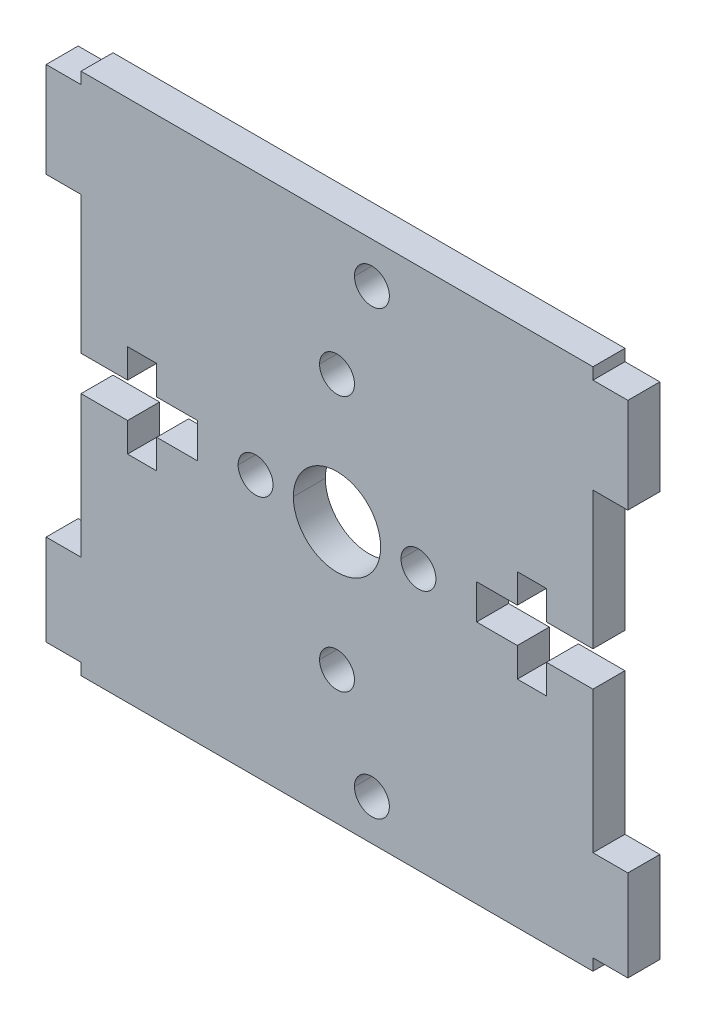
ISO-10303-21;
HEADER;
FILE_DESCRIPTION(('STEP AP214'),'2;1');
FILE_NAME('part.step','',(''),(''),'','','');
FILE_SCHEMA(('AUTOMOTIVE_DESIGN { 1 0 10303 214 1 1 1 1 }'));
ENDSEC;
DATA;
#1=APPLICATION_CONTEXT('core data for automotive mechanical design processes');
#2=APPLICATION_PROTOCOL_DEFINITION('international standard','automotive_design',2000,#1);
#3=PRODUCT_CONTEXT('',#1,'mechanical');
#4=PRODUCT('Part','Part','',(#3));
#5=PRODUCT_RELATED_PRODUCT_CATEGORY('part','',(#4));
#6=PRODUCT_DEFINITION_FORMATION('','',#4);
#7=PRODUCT_DEFINITION_CONTEXT('part definition',#1,'design');
#8=PRODUCT_DEFINITION('design','',#6,#7);
#9=PRODUCT_DEFINITION_SHAPE('','',#8);
#10=(LENGTH_UNIT() NAMED_UNIT(*) SI_UNIT(.MILLI.,.METRE.));
#11=(NAMED_UNIT(*) PLANE_ANGLE_UNIT() SI_UNIT($,.RADIAN.));
#12=(NAMED_UNIT(*) SI_UNIT($,.STERADIAN.) SOLID_ANGLE_UNIT());
#13=UNCERTAINTY_MEASURE_WITH_UNIT(LENGTH_MEASURE(1.E-05),#10,'distance_accuracy_value','');
#14=(GEOMETRIC_REPRESENTATION_CONTEXT(3) GLOBAL_UNCERTAINTY_ASSIGNED_CONTEXT((#13)) GLOBAL_UNIT_ASSIGNED_CONTEXT((#10,
#11,#12)) REPRESENTATION_CONTEXT('',''));
#15=CARTESIAN_POINT('',(0.,0.,0.));
#16=DIRECTION('',(0.,0.,1.));
#17=DIRECTION('',(1.,0.,0.));
#18=AXIS2_PLACEMENT_3D('',#15,#16,#17);
#19=CARTESIAN_POINT('',(0.,0.,0.));
#20=DIRECTION('',(0.,0.,1.));
#21=DIRECTION('',(1.,0.,0.));
#22=AXIS2_PLACEMENT_3D('',#19,#20,#21);
#23=PLANE('',#22);
#24=CARTESIAN_POINT('',(-41.0081349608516,-106.996613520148,0.));
#25=DIRECTION('',(0.,0.,-1.));
#26=DIRECTION('',(-1.,0.,0.));
#27=AXIS2_PLACEMENT_3D('',#24,#25,#26);
#28=CIRCLE('',#27,1.5);
#29=CARTESIAN_POINT('',(-39.5081349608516,-106.996613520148,0.));
#30=VERTEX_POINT('',#29);
#31=CARTESIAN_POINT('',(-42.5081349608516,-106.996613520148,0.));
#32=VERTEX_POINT('',#31);
#33=EDGE_CURVE('E579',#30,#32,#28,.F.);
#34=ORIENTED_EDGE('',*,*,#33,.T.);
#35=CARTESIAN_POINT('',(-41.0081349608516,-106.996613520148,0.));
#36=DIRECTION('',(0.,0.,-1.));
#37=DIRECTION('',(-1.,0.,0.));
#38=AXIS2_PLACEMENT_3D('',#35,#36,#37);
#39=CIRCLE('',#38,1.5);
#40=EDGE_CURVE('E588',#32,#30,#39,.F.);
#41=ORIENTED_EDGE('',*,*,#40,.T.);
#42=EDGE_LOOP('',(#34,#41));
#43=FACE_BOUND('',#42,.T.);
#44=CARTESIAN_POINT('',(-44.0081349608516,-99.0456196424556,0.));
#45=DIRECTION('',(0.,0.,-1.));
#46=DIRECTION('',(-1.,0.,0.));
#47=AXIS2_PLACEMENT_3D('',#44,#45,#46);
#48=CIRCLE('',#47,1.5);
#49=CARTESIAN_POINT('',(-42.5081349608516,-99.0456196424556,0.));
#50=VERTEX_POINT('',#49);
#51=CARTESIAN_POINT('',(-45.5081349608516,-99.0456196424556,0.));
#52=VERTEX_POINT('',#51);
#53=EDGE_CURVE('E586',#50,#52,#48,.F.);
#54=ORIENTED_EDGE('',*,*,#53,.T.);
#55=CARTESIAN_POINT('',(-44.0081349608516,-99.0456196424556,0.));
#56=DIRECTION('',(0.,0.,-1.));
#57=DIRECTION('',(-1.,0.,0.));
#58=AXIS2_PLACEMENT_3D('',#55,#56,#57);
#59=CIRCLE('',#58,1.5);
#60=EDGE_CURVE('E595',#52,#50,#59,.F.);
#61=ORIENTED_EDGE('',*,*,#60,.T.);
#62=EDGE_LOOP('',(#54,#61));
#63=FACE_BOUND('',#62,.T.);
#64=CARTESIAN_POINT('',(-51.0081349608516,-88.0456196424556,0.));
#65=DIRECTION('',(0.,0.,-1.));
#66=DIRECTION('',(-1.,0.,0.));
#67=AXIS2_PLACEMENT_3D('',#64,#65,#66);
#68=CIRCLE('',#67,1.5);
#69=CARTESIAN_POINT('',(-49.5081349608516,-88.0456196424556,0.));
#70=VERTEX_POINT('',#69);
#71=CARTESIAN_POINT('',(-52.5081349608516,-88.0456196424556,0.));
#72=VERTEX_POINT('',#71);
#73=EDGE_CURVE('E593',#70,#72,#68,.F.);
#74=ORIENTED_EDGE('',*,*,#73,.T.);
#75=CARTESIAN_POINT('',(-51.0081349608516,-88.0456196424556,0.));
#76=DIRECTION('',(0.,0.,-1.));
#77=DIRECTION('',(-1.,0.,0.));
#78=AXIS2_PLACEMENT_3D('',#75,#76,#77);
#79=CIRCLE('',#78,1.5);
#80=EDGE_CURVE('E602',#72,#70,#79,.F.);
#81=ORIENTED_EDGE('',*,*,#80,.T.);
#82=EDGE_LOOP('',(#74,#81));
#83=FACE_BOUND('',#82,.T.);
#84=CARTESIAN_POINT('',(-44.0081349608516,-88.0456196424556,0.));
#85=DIRECTION('',(0.,0.,-1.));
#86=DIRECTION('',(-1.,0.,0.));
#87=AXIS2_PLACEMENT_3D('',#84,#85,#86);
#88=CIRCLE('',#87,3.75);
#89=CARTESIAN_POINT('',(-40.2581349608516,-88.0456196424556,0.));
#90=VERTEX_POINT('',#89);
#91=CARTESIAN_POINT('',(-47.7581349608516,-88.0456196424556,0.));
#92=VERTEX_POINT('',#91);
#93=EDGE_CURVE('E600',#90,#92,#88,.F.);
#94=ORIENTED_EDGE('',*,*,#93,.T.);
#95=CARTESIAN_POINT('',(-44.0081349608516,-88.0456196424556,0.));
#96=DIRECTION('',(0.,0.,-1.));
#97=DIRECTION('',(-1.,0.,0.));
#98=AXIS2_PLACEMENT_3D('',#95,#96,#97);
#99=CIRCLE('',#98,3.75);
#100=EDGE_CURVE('E606',#92,#90,#99,.F.);
#101=ORIENTED_EDGE('',*,*,#100,.T.);
#102=EDGE_LOOP('',(#94,#101));
#103=FACE_BOUND('',#102,.T.);
#104=CARTESIAN_POINT('',(-37.0081349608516,-88.0456196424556,0.));
#105=DIRECTION('',(0.,0.,-1.));
#106=DIRECTION('',(-1.,0.,0.));
#107=AXIS2_PLACEMENT_3D('',#104,#105,#106);
#108=CIRCLE('',#107,1.5);
#109=CARTESIAN_POINT('',(-35.5081349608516,-88.0456196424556,0.));
#110=VERTEX_POINT('',#109);
#111=CARTESIAN_POINT('',(-38.5081349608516,-88.0456196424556,0.));
#112=VERTEX_POINT('',#111);
#113=EDGE_CURVE('E715',#110,#112,#108,.F.);
#114=ORIENTED_EDGE('',*,*,#113,.T.);
#115=CARTESIAN_POINT('',(-37.0081349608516,-88.0456196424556,0.));
#116=DIRECTION('',(0.,0.,-1.));
#117=DIRECTION('',(-1.,0.,0.));
#118=AXIS2_PLACEMENT_3D('',#115,#116,#117);
#119=CIRCLE('',#118,1.5);
#120=EDGE_CURVE('E723',#112,#110,#119,.F.);
#121=ORIENTED_EDGE('',*,*,#120,.T.);
#122=EDGE_LOOP('',(#114,#121));
#123=FACE_BOUND('',#122,.T.);
#124=CARTESIAN_POINT('',(-44.0081349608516,-77.0456196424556,0.));
#125=DIRECTION('',(0.,0.,-1.));
#126=DIRECTION('',(-1.,0.,0.));
#127=AXIS2_PLACEMENT_3D('',#124,#125,#126);
#128=CIRCLE('',#127,1.5);
#129=CARTESIAN_POINT('',(-42.5081349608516,-77.0456196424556,0.));
#130=VERTEX_POINT('',#129);
#131=CARTESIAN_POINT('',(-45.5081349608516,-77.0456196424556,0.));
#132=VERTEX_POINT('',#131);
#133=EDGE_CURVE('E721',#130,#132,#128,.F.);
#134=ORIENTED_EDGE('',*,*,#133,.T.);
#135=CARTESIAN_POINT('',(-44.0081349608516,-77.0456196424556,0.));
#136=DIRECTION('',(0.,0.,-1.));
#137=DIRECTION('',(-1.,0.,0.));
#138=AXIS2_PLACEMENT_3D('',#135,#136,#137);
#139=CIRCLE('',#138,1.5);
#140=EDGE_CURVE('E730',#132,#130,#139,.F.);
#141=ORIENTED_EDGE('',*,*,#140,.T.);
#142=EDGE_LOOP('',(#134,#141));
#143=FACE_BOUND('',#142,.T.);
#144=CARTESIAN_POINT('',(-41.0081349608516,-68.9966135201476,0.));
#145=DIRECTION('',(0.,0.,-1.));
#146=DIRECTION('',(-1.,0.,0.));
#147=AXIS2_PLACEMENT_3D('',#144,#145,#146);
#148=CIRCLE('',#147,1.5);
#149=CARTESIAN_POINT('',(-39.5081349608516,-68.9966135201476,0.));
#150=VERTEX_POINT('',#149);
#151=CARTESIAN_POINT('',(-42.5081349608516,-68.9966135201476,0.));
#152=VERTEX_POINT('',#151);
#153=EDGE_CURVE('E728',#150,#152,#148,.F.);
#154=ORIENTED_EDGE('',*,*,#153,.T.);
#155=CARTESIAN_POINT('',(-41.0081349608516,-68.9966135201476,0.));
#156=DIRECTION('',(0.,0.,-1.));
#157=DIRECTION('',(-1.,0.,0.));
#158=AXIS2_PLACEMENT_3D('',#155,#156,#157);
#159=CIRCLE('',#158,1.5);
#160=EDGE_CURVE('E734',#152,#150,#159,.F.);
#161=ORIENTED_EDGE('',*,*,#160,.T.);
#162=EDGE_LOOP('',(#154,#161));
#163=FACE_BOUND('',#162,.T.);
#164=DIRECTION('',(0.,-1.,0.));
#165=VECTOR('',#164,1.);
#166=CARTESIAN_POINT('',(-28.51,-84.,0.));
#167=LINE('',#166,#165);
#168=CARTESIAN_POINT('',(-28.51,-89.4966135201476,0.));
#169=VERTEX_POINT('',#168);
#170=CARTESIAN_POINT('',(-28.51,-92.,0.));
#171=VERTEX_POINT('',#170);
#172=EDGE_CURVE('E796',#169,#171,#167,.T.);
#173=ORIENTED_EDGE('',*,*,#172,.T.);
#174=DIRECTION('',(1.,0.,0.));
#175=VECTOR('',#174,1.);
#176=CARTESIAN_POINT('',(-28.51,-92.,0.));
#177=LINE('',#176,#175);
#178=CARTESIAN_POINT('',(-26.01,-92.,0.));
#179=VERTEX_POINT('',#178);
#180=EDGE_CURVE('E795',#171,#179,#177,.T.);
#181=ORIENTED_EDGE('',*,*,#180,.T.);
#182=DIRECTION('',(0.,1.,0.));
#183=VECTOR('',#182,1.);
#184=CARTESIAN_POINT('',(-26.01,-84.,0.));
#185=LINE('',#184,#183);
#186=CARTESIAN_POINT('',(-26.01,-90.9966135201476,0.));
#187=VERTEX_POINT('',#186);
#188=EDGE_CURVE('E1054',#179,#187,#185,.T.);
#189=ORIENTED_EDGE('',*,*,#188,.T.);
#190=DIRECTION('',(1.,0.,0.));
#191=VECTOR('',#190,1.);
#192=CARTESIAN_POINT('',(-28.5081349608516,-90.9966135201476,0.));
#193=LINE('',#192,#191);
#194=CARTESIAN_POINT('',(-26.0081349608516,-90.9966135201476,0.));
#195=VERTEX_POINT('',#194);
#196=EDGE_CURVE('E633',#187,#195,#193,.T.);
#197=ORIENTED_EDGE('',*,*,#196,.T.);
#198=DIRECTION('',(0.,1.,0.));
#199=VECTOR('',#198,1.);
#200=CARTESIAN_POINT('',(-26.0081349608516,0.,0.));
#201=LINE('',#200,#199);
#202=CARTESIAN_POINT('',(-26.0081349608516,-89.4966135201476,0.));
#203=VERTEX_POINT('',#202);
#204=EDGE_CURVE('E735',#203,#195,#201,.F.);
#205=ORIENTED_EDGE('',*,*,#204,.F.);
#206=DIRECTION('',(1.,0.,0.));
#207=VECTOR('',#206,1.);
#208=CARTESIAN_POINT('',(-26.0081349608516,-89.4966135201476,0.));
#209=LINE('',#208,#207);
#210=CARTESIAN_POINT('',(-22.01,-89.4966135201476,0.));
#211=VERTEX_POINT('',#210);
#212=EDGE_CURVE('E638',#203,#211,#209,.T.);
#213=ORIENTED_EDGE('',*,*,#212,.T.);
#214=DIRECTION('',(0.,-1.,0.));
#215=VECTOR('',#214,1.);
#216=CARTESIAN_POINT('',(-22.01,-74.6744250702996,0.));
#217=LINE('',#216,#215);
#218=CARTESIAN_POINT('',(-22.01,-101.6744250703,0.));
#219=VERTEX_POINT('',#218);
#220=EDGE_CURVE('E536',#211,#219,#217,.T.);
#221=ORIENTED_EDGE('',*,*,#220,.T.);
#222=DIRECTION('',(1.,0.,0.));
#223=VECTOR('',#222,1.);
#224=CARTESIAN_POINT('',(-19.,-101.6744250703,0.));
#225=LINE('',#224,#223);
#226=CARTESIAN_POINT('',(-19.0081349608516,-101.6744250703,0.));
#227=VERTEX_POINT('',#226);
#228=EDGE_CURVE('E540',#219,#227,#225,.T.);
#229=ORIENTED_EDGE('',*,*,#228,.T.);
#230=DIRECTION('',(0.,-1.,0.));
#231=VECTOR('',#230,1.);
#232=CARTESIAN_POINT('',(-19.0081349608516,-100.496613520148,0.));
#233=LINE('',#232,#231);
#234=CARTESIAN_POINT('',(-19.0081349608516,-109.496613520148,0.));
#235=VERTEX_POINT('',#234);
#236=EDGE_CURVE('E643',#227,#235,#233,.T.);
#237=ORIENTED_EDGE('',*,*,#236,.T.);
#238=DIRECTION('',(-1.,0.,0.));
#239=VECTOR('',#238,1.);
#240=CARTESIAN_POINT('',(-19.0081349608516,-109.496613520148,0.));
#241=LINE('',#240,#239);
#242=CARTESIAN_POINT('',(-22.0081349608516,-109.496613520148,0.));
#243=VERTEX_POINT('',#242);
#244=EDGE_CURVE('E522',#235,#243,#241,.T.);
#245=ORIENTED_EDGE('',*,*,#244,.T.);
#246=DIRECTION('',(0.,-1.,0.));
#247=VECTOR('',#246,1.);
#248=CARTESIAN_POINT('',(-22.0081349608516,-110.496613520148,0.));
#249=LINE('',#248,#247);
#250=CARTESIAN_POINT('',(-22.0081349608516,-110.496613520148,0.));
#251=VERTEX_POINT('',#250);
#252=EDGE_CURVE('E525',#243,#251,#249,.T.);
#253=ORIENTED_EDGE('',*,*,#252,.T.);
#254=DIRECTION('',(1.,0.,0.));
#255=VECTOR('',#254,1.);
#256=CARTESIAN_POINT('',(-69.0081349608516,-110.496613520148,0.));
#257=LINE('',#256,#255);
#258=CARTESIAN_POINT('',(-66.0081349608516,-110.496613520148,0.));
#259=VERTEX_POINT('',#258);
#260=EDGE_CURVE('E646',#251,#259,#257,.F.);
#261=ORIENTED_EDGE('',*,*,#260,.T.);
#262=DIRECTION('',(0.,1.,0.));
#263=VECTOR('',#262,1.);
#264=CARTESIAN_POINT('',(-66.0081349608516,-110.496613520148,0.));
#265=LINE('',#264,#263);
#266=CARTESIAN_POINT('',(-66.0081349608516,-109.496613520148,0.));
#267=VERTEX_POINT('',#266);
#268=EDGE_CURVE('E490',#259,#267,#265,.T.);
#269=ORIENTED_EDGE('',*,*,#268,.T.);
#270=DIRECTION('',(-1.,0.,0.));
#271=VECTOR('',#270,1.);
#272=CARTESIAN_POINT('',(-69.0081349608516,-109.496613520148,0.));
#273=LINE('',#272,#271);
#274=CARTESIAN_POINT('',(-69.0081349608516,-109.496613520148,0.));
#275=VERTEX_POINT('',#274);
#276=EDGE_CURVE('E851',#267,#275,#273,.T.);
#277=ORIENTED_EDGE('',*,*,#276,.T.);
#278=DIRECTION('',(0.,1.,0.));
#279=VECTOR('',#278,1.);
#280=CARTESIAN_POINT('',(-69.0081349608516,-100.496613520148,0.));
#281=LINE('',#280,#279);
#282=CARTESIAN_POINT('',(-69.0081349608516,-101.6744250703,0.));
#283=VERTEX_POINT('',#282);
#284=EDGE_CURVE('E648',#275,#283,#281,.T.);
#285=ORIENTED_EDGE('',*,*,#284,.T.);
#286=DIRECTION('',(1.,0.,0.));
#287=VECTOR('',#286,1.);
#288=CARTESIAN_POINT('',(-69.01,-101.6744250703,0.));
#289=LINE('',#288,#287);
#290=CARTESIAN_POINT('',(-66.01,-101.6744250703,0.));
#291=VERTEX_POINT('',#290);
#292=EDGE_CURVE('E550',#283,#291,#289,.T.);
#293=ORIENTED_EDGE('',*,*,#292,.T.);
#294=DIRECTION('',(0.,1.,0.));
#295=VECTOR('',#294,1.);
#296=CARTESIAN_POINT('',(-66.01,-74.6744250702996,0.));
#297=LINE('',#296,#295);
#298=CARTESIAN_POINT('',(-66.01,-100.496613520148,0.));
#299=VERTEX_POINT('',#298);
#300=EDGE_CURVE('E554',#291,#299,#297,.T.);
#301=ORIENTED_EDGE('',*,*,#300,.T.);
#302=DIRECTION('',(1.,0.,0.));
#303=VECTOR('',#302,1.);
#304=CARTESIAN_POINT('',(-69.0081349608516,-100.496613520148,0.));
#305=LINE('',#304,#303);
#306=CARTESIAN_POINT('',(-66.0081349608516,-100.496613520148,0.));
#307=VERTEX_POINT('',#306);
#308=EDGE_CURVE('E650',#299,#307,#305,.T.);
#309=ORIENTED_EDGE('',*,*,#308,.T.);
#310=DIRECTION('',(0.,1.,0.));
#311=VECTOR('',#310,1.);
#312=CARTESIAN_POINT('',(-66.0081349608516,-100.496613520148,0.));
#313=LINE('',#312,#311);
#314=CARTESIAN_POINT('',(-66.0081349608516,-89.4966135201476,0.));
#315=VERTEX_POINT('',#314);
#316=EDGE_CURVE('E655',#307,#315,#313,.T.);
#317=ORIENTED_EDGE('',*,*,#316,.T.);
#318=DIRECTION('',(1.,0.,0.));
#319=VECTOR('',#318,1.);
#320=CARTESIAN_POINT('',(-62.0081349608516,-89.4966135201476,0.));
#321=LINE('',#320,#319);
#322=CARTESIAN_POINT('',(-62.01,-89.4966135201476,0.));
#323=VERTEX_POINT('',#322);
#324=EDGE_CURVE('E661',#315,#323,#321,.T.);
#325=ORIENTED_EDGE('',*,*,#324,.T.);
#326=DIRECTION('',(0.,-1.,0.));
#327=VECTOR('',#326,1.);
#328=CARTESIAN_POINT('',(-62.01,-84.,0.));
#329=LINE('',#328,#327);
#330=CARTESIAN_POINT('',(-62.01,-92.,0.));
#331=VERTEX_POINT('',#330);
#332=EDGE_CURVE('E816',#323,#331,#329,.T.);
#333=ORIENTED_EDGE('',*,*,#332,.T.);
#334=DIRECTION('',(1.,0.,0.));
#335=VECTOR('',#334,1.);
#336=CARTESIAN_POINT('',(-62.01,-92.,0.));
#337=LINE('',#336,#335);
#338=CARTESIAN_POINT('',(-59.51,-92.,0.));
#339=VERTEX_POINT('',#338);
#340=EDGE_CURVE('E827',#331,#339,#337,.T.);
#341=ORIENTED_EDGE('',*,*,#340,.T.);
#342=DIRECTION('',(0.,1.,0.));
#343=VECTOR('',#342,1.);
#344=CARTESIAN_POINT('',(-59.51,-84.,0.));
#345=LINE('',#344,#343);
#346=CARTESIAN_POINT('',(-59.51,-90.9966135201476,0.));
#347=VERTEX_POINT('',#346);
#348=EDGE_CURVE('E831',#339,#347,#345,.T.);
#349=ORIENTED_EDGE('',*,*,#348,.T.);
#350=DIRECTION('',(1.,0.,0.));
#351=VECTOR('',#350,1.);
#352=CARTESIAN_POINT('',(-59.5081349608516,-90.9966135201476,0.));
#353=LINE('',#352,#351);
#354=CARTESIAN_POINT('',(-59.5081349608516,-90.9966135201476,0.));
#355=VERTEX_POINT('',#354);
#356=EDGE_CURVE('E664',#347,#355,#353,.T.);
#357=ORIENTED_EDGE('',*,*,#356,.T.);
#358=DIRECTION('',(0.,1.,0.));
#359=VECTOR('',#358,1.);
#360=CARTESIAN_POINT('',(-59.5081349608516,0.,0.));
#361=LINE('',#360,#359);
#362=CARTESIAN_POINT('',(-59.5081349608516,-89.4966135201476,0.));
#363=VERTEX_POINT('',#362);
#364=EDGE_CURVE('E738',#363,#355,#361,.F.);
#365=ORIENTED_EDGE('',*,*,#364,.F.);
#366=DIRECTION('',(1.,0.,0.));
#367=VECTOR('',#366,1.);
#368=CARTESIAN_POINT('',(-56.0081349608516,-89.4966135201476,0.));
#369=LINE('',#368,#367);
#370=CARTESIAN_POINT('',(-56.0081349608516,-89.4966135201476,0.));
#371=VERTEX_POINT('',#370);
#372=EDGE_CURVE('E669',#363,#371,#369,.T.);
#373=ORIENTED_EDGE('',*,*,#372,.T.);
#374=DIRECTION('',(0.,1.,0.));
#375=VECTOR('',#374,1.);
#376=CARTESIAN_POINT('',(-56.0081349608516,-89.4966135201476,0.));
#377=LINE('',#376,#375);
#378=CARTESIAN_POINT('',(-56.0081349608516,-86.4966135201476,0.));
#379=VERTEX_POINT('',#378);
#380=EDGE_CURVE('E677',#371,#379,#377,.T.);
#381=ORIENTED_EDGE('',*,*,#380,.T.);
#382=DIRECTION('',(1.,0.,0.));
#383=VECTOR('',#382,1.);
#384=CARTESIAN_POINT('',(-56.0081349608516,-86.4966135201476,0.));
#385=LINE('',#384,#383);
#386=CARTESIAN_POINT('',(-59.5081349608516,-86.4966135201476,0.));
#387=VERTEX_POINT('',#386);
#388=EDGE_CURVE('E683',#379,#387,#385,.F.);
#389=ORIENTED_EDGE('',*,*,#388,.T.);
#390=DIRECTION('',(0.,1.,0.));
#391=VECTOR('',#390,1.);
#392=CARTESIAN_POINT('',(-59.5081349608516,0.,0.));
#393=LINE('',#392,#391);
#394=CARTESIAN_POINT('',(-59.5081349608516,-84.9966135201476,0.));
#395=VERTEX_POINT('',#394);
#396=EDGE_CURVE('E574',#395,#387,#393,.F.);
#397=ORIENTED_EDGE('',*,*,#396,.F.);
#398=DIRECTION('',(1.,0.,0.));
#399=VECTOR('',#398,1.);
#400=CARTESIAN_POINT('',(-59.5081349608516,-84.9966135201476,0.));
#401=LINE('',#400,#399);
#402=CARTESIAN_POINT('',(-59.51,-84.9966135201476,0.));
#403=VERTEX_POINT('',#402);
#404=EDGE_CURVE('E689',#395,#403,#401,.F.);
#405=ORIENTED_EDGE('',*,*,#404,.T.);
#406=CARTESIAN_POINT('',(-59.51,-84.,0.));
#407=VERTEX_POINT('',#406);
#408=EDGE_CURVE('E830',#403,#407,#345,.T.);
#409=ORIENTED_EDGE('',*,*,#408,.T.);
#410=DIRECTION('',(-1.,0.,0.));
#411=VECTOR('',#410,1.);
#412=CARTESIAN_POINT('',(-62.01,-84.,0.));
#413=LINE('',#412,#411);
#414=CARTESIAN_POINT('',(-62.01,-84.,0.));
#415=VERTEX_POINT('',#414);
#416=EDGE_CURVE('E834',#407,#415,#413,.T.);
#417=ORIENTED_EDGE('',*,*,#416,.T.);
#418=CARTESIAN_POINT('',(-62.01,-86.4966135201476,0.));
#419=VERTEX_POINT('',#418);
#420=EDGE_CURVE('E820',#415,#419,#329,.T.);
#421=ORIENTED_EDGE('',*,*,#420,.T.);
#422=DIRECTION('',(1.,0.,0.));
#423=VECTOR('',#422,1.);
#424=CARTESIAN_POINT('',(-62.0081349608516,-86.4966135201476,0.));
#425=LINE('',#424,#423);
#426=CARTESIAN_POINT('',(-66.0081349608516,-86.4966135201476,0.));
#427=VERTEX_POINT('',#426);
#428=EDGE_CURVE('E694',#419,#427,#425,.F.);
#429=ORIENTED_EDGE('',*,*,#428,.T.);
#430=DIRECTION('',(0.,1.,0.));
#431=VECTOR('',#430,1.);
#432=CARTESIAN_POINT('',(-66.0081349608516,-86.4966135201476,0.));
#433=LINE('',#432,#431);
#434=CARTESIAN_POINT('',(-66.0081349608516,-75.4966135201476,0.));
#435=VERTEX_POINT('',#434);
#436=EDGE_CURVE('E699',#427,#435,#433,.T.);
#437=ORIENTED_EDGE('',*,*,#436,.T.);
#438=DIRECTION('',(1.,0.,0.));
#439=VECTOR('',#438,1.);
#440=CARTESIAN_POINT('',(-69.0081349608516,-75.4966135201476,0.));
#441=LINE('',#440,#439);
#442=CARTESIAN_POINT('',(-66.01,-75.4966135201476,0.));
#443=VERTEX_POINT('',#442);
#444=EDGE_CURVE('E705',#435,#443,#441,.F.);
#445=ORIENTED_EDGE('',*,*,#444,.T.);
#446=CARTESIAN_POINT('',(-66.01,-74.6744250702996,0.));
#447=VERTEX_POINT('',#446);
#448=EDGE_CURVE('E553',#443,#447,#297,.T.);
#449=ORIENTED_EDGE('',*,*,#448,.T.);
#450=DIRECTION('',(-1.,0.,0.));
#451=VECTOR('',#450,1.);
#452=CARTESIAN_POINT('',(-69.01,-74.6744250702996,0.));
#453=LINE('',#452,#451);
#454=CARTESIAN_POINT('',(-69.0081349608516,-74.6744250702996,0.));
#455=VERTEX_POINT('',#454);
#456=EDGE_CURVE('E557',#447,#455,#453,.T.);
#457=ORIENTED_EDGE('',*,*,#456,.T.);
#458=DIRECTION('',(0.,1.,0.));
#459=VECTOR('',#458,1.);
#460=CARTESIAN_POINT('',(-69.0081349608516,-65.4966135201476,0.));
#461=LINE('',#460,#459);
#462=CARTESIAN_POINT('',(-69.0081349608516,-66.4966135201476,0.));
#463=VERTEX_POINT('',#462);
#464=EDGE_CURVE('E708',#455,#463,#461,.T.);
#465=ORIENTED_EDGE('',*,*,#464,.T.);
#466=DIRECTION('',(1.,0.,0.));
#467=VECTOR('',#466,1.);
#468=CARTESIAN_POINT('',(-69.0081349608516,-66.4966135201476,0.));
#469=LINE('',#468,#467);
#470=CARTESIAN_POINT('',(-66.0081349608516,-66.4966135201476,0.));
#471=VERTEX_POINT('',#470);
#472=EDGE_CURVE('E492',#463,#471,#469,.T.);
#473=ORIENTED_EDGE('',*,*,#472,.T.);
#474=DIRECTION('',(0.,1.,0.));
#475=VECTOR('',#474,1.);
#476=CARTESIAN_POINT('',(-66.0081349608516,-65.4966135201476,0.));
#477=LINE('',#476,#475);
#478=CARTESIAN_POINT('',(-66.0081349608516,-65.4966135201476,0.));
#479=VERTEX_POINT('',#478);
#480=EDGE_CURVE('E496',#471,#479,#477,.T.);
#481=ORIENTED_EDGE('',*,*,#480,.T.);
#482=DIRECTION('',(1.,0.,0.));
#483=VECTOR('',#482,1.);
#484=CARTESIAN_POINT('',(-69.0081349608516,-65.4966135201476,0.));
#485=LINE('',#484,#483);
#486=CARTESIAN_POINT('',(-22.0081349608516,-65.4966135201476,0.));
#487=VERTEX_POINT('',#486);
#488=EDGE_CURVE('E603',#479,#487,#485,.T.);
#489=ORIENTED_EDGE('',*,*,#488,.T.);
#490=DIRECTION('',(0.,-1.,0.));
#491=VECTOR('',#490,1.);
#492=CARTESIAN_POINT('',(-22.0081349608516,-65.4966135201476,0.));
#493=LINE('',#492,#491);
#494=CARTESIAN_POINT('',(-22.0081349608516,-66.4966135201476,0.));
#495=VERTEX_POINT('',#494);
#496=EDGE_CURVE('E510',#487,#495,#493,.T.);
#497=ORIENTED_EDGE('',*,*,#496,.T.);
#498=DIRECTION('',(1.,0.,0.));
#499=VECTOR('',#498,1.);
#500=CARTESIAN_POINT('',(-19.0081349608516,-66.4966135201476,0.));
#501=LINE('',#500,#499);
#502=CARTESIAN_POINT('',(-19.0081349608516,-66.4966135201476,0.));
#503=VERTEX_POINT('',#502);
#504=EDGE_CURVE('E513',#495,#503,#501,.T.);
#505=ORIENTED_EDGE('',*,*,#504,.T.);
#506=DIRECTION('',(0.,-1.,0.));
#507=VECTOR('',#506,1.);
#508=CARTESIAN_POINT('',(-19.0081349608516,-65.4966135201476,0.));
#509=LINE('',#508,#507);
#510=CARTESIAN_POINT('',(-19.0081349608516,-74.6744250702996,0.));
#511=VERTEX_POINT('',#510);
#512=EDGE_CURVE('E607',#503,#511,#509,.T.);
#513=ORIENTED_EDGE('',*,*,#512,.T.);
#514=DIRECTION('',(-1.,0.,0.));
#515=VECTOR('',#514,1.);
#516=CARTESIAN_POINT('',(-19.,-74.6744250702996,0.));
#517=LINE('',#516,#515);
#518=CARTESIAN_POINT('',(-22.01,-74.6744250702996,0.));
#519=VERTEX_POINT('',#518);
#520=EDGE_CURVE('E533',#511,#519,#517,.T.);
#521=ORIENTED_EDGE('',*,*,#520,.T.);
#522=CARTESIAN_POINT('',(-22.01,-86.4966135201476,0.));
#523=VERTEX_POINT('',#522);
#524=EDGE_CURVE('E537',#519,#523,#217,.T.);
#525=ORIENTED_EDGE('',*,*,#524,.T.);
#526=DIRECTION('',(1.,0.,0.));
#527=VECTOR('',#526,1.);
#528=CARTESIAN_POINT('',(-26.0081349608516,-86.4966135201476,0.));
#529=LINE('',#528,#527);
#530=CARTESIAN_POINT('',(-26.0081349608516,-86.4966135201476,0.));
#531=VERTEX_POINT('',#530);
#532=EDGE_CURVE('E609',#523,#531,#529,.F.);
#533=ORIENTED_EDGE('',*,*,#532,.T.);
#534=DIRECTION('',(0.,1.,0.));
#535=VECTOR('',#534,1.);
#536=CARTESIAN_POINT('',(-26.0081349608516,0.,0.));
#537=LINE('',#536,#535);
#538=CARTESIAN_POINT('',(-26.0081349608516,-84.9966135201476,0.));
#539=VERTEX_POINT('',#538);
#540=EDGE_CURVE('E731',#539,#531,#537,.F.);
#541=ORIENTED_EDGE('',*,*,#540,.F.);
#542=DIRECTION('',(1.,0.,0.));
#543=VECTOR('',#542,1.);
#544=CARTESIAN_POINT('',(-28.5081349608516,-84.9966135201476,0.));
#545=LINE('',#544,#543);
#546=CARTESIAN_POINT('',(-26.01,-84.9966135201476,0.));
#547=VERTEX_POINT('',#546);
#548=EDGE_CURVE('E614',#539,#547,#545,.F.);
#549=ORIENTED_EDGE('',*,*,#548,.T.);
#550=CARTESIAN_POINT('',(-26.01,-84.,0.));
#551=VERTEX_POINT('',#550);
#552=EDGE_CURVE('E1052',#547,#551,#185,.T.);
#553=ORIENTED_EDGE('',*,*,#552,.T.);
#554=DIRECTION('',(-1.,0.,0.));
#555=VECTOR('',#554,1.);
#556=CARTESIAN_POINT('',(-28.51,-84.,0.));
#557=LINE('',#556,#555);
#558=CARTESIAN_POINT('',(-28.51,-84.,0.));
#559=VERTEX_POINT('',#558);
#560=EDGE_CURVE('E794',#551,#559,#557,.T.);
#561=ORIENTED_EDGE('',*,*,#560,.T.);
#562=CARTESIAN_POINT('',(-28.51,-86.4966135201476,0.));
#563=VERTEX_POINT('',#562);
#564=EDGE_CURVE('E783',#559,#563,#167,.T.);
#565=ORIENTED_EDGE('',*,*,#564,.T.);
#566=DIRECTION('',(1.,0.,0.));
#567=VECTOR('',#566,1.);
#568=CARTESIAN_POINT('',(-32.0081349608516,-86.4966135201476,0.));
#569=LINE('',#568,#567);
#570=CARTESIAN_POINT('',(-32.0081349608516,-86.4966135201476,0.));
#571=VERTEX_POINT('',#570);
#572=EDGE_CURVE('E619',#563,#571,#569,.F.);
#573=ORIENTED_EDGE('',*,*,#572,.T.);
#574=DIRECTION('',(0.,1.,0.));
#575=VECTOR('',#574,1.);
#576=CARTESIAN_POINT('',(-32.0081349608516,-89.4966135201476,0.));
#577=LINE('',#576,#575);
#578=CARTESIAN_POINT('',(-32.0081349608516,-89.4966135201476,0.));
#579=VERTEX_POINT('',#578);
#580=EDGE_CURVE('E624',#571,#579,#577,.F.);
#581=ORIENTED_EDGE('',*,*,#580,.T.);
#582=DIRECTION('',(1.,0.,0.));
#583=VECTOR('',#582,1.);
#584=CARTESIAN_POINT('',(-32.0081349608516,-89.4966135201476,0.));
#585=LINE('',#584,#583);
#586=EDGE_CURVE('E630',#579,#169,#585,.T.);
#587=ORIENTED_EDGE('',*,*,#586,.T.);
#588=EDGE_LOOP('',(#173,#181,#189,#197,#205,#213,#221,#229,#237,#245,#253,#261,#269,#277,#285,
#293,#301,#309,#317,#325,#333,#341,#349,#357,#365,#373,#381,#389,#397,#405,#409,#417,#421,#429,
#437,#445,#449,#457,#465,#473,#481,#489,#497,#505,#513,#521,#525,#533,#541,#549,#553,#561,#565,
#573,#581,#587));
#589=FACE_BOUND('',#588,.T.);
#590=ADVANCED_FACE('F31',(#43,#63,#83,#103,#123,#143,#163,#589),#23,.F.);
#591=CARTESIAN_POINT('',(-28.5081349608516,-90.9966135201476,3.));
#592=DIRECTION('',(0.,-1.,0.));
#593=DIRECTION('',(0.,0.,-1.));
#594=AXIS2_PLACEMENT_3D('',#591,#592,#593);
#595=PLANE('',#594);
#596=DIRECTION('',(0.,0.,-1.));
#597=VECTOR('',#596,1.);
#598=CARTESIAN_POINT('',(-26.01,-90.9966135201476,3.));
#599=LINE('',#598,#597);
#600=CARTESIAN_POINT('',(-26.01,-90.9966135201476,2.75));
#601=VERTEX_POINT('',#600);
#602=EDGE_CURVE('E817',#601,#187,#599,.T.);
#603=ORIENTED_EDGE('',*,*,#602,.F.);
#604=DIRECTION('',(1.,0.,0.));
#605=VECTOR('',#604,1.);
#606=CARTESIAN_POINT('',(-28.5081349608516,-90.9966135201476,2.75));
#607=LINE('',#606,#605);
#608=CARTESIAN_POINT('',(-26.0081349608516,-90.9966135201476,2.75));
#609=VERTEX_POINT('',#608);
#610=EDGE_CURVE('E1081',#601,#609,#607,.T.);
#611=ORIENTED_EDGE('',*,*,#610,.T.);
#612=DIRECTION('',(0.,0.,-1.));
#613=VECTOR('',#612,1.);
#614=CARTESIAN_POINT('',(-26.0081349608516,-90.9966135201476,3.));
#615=LINE('',#614,#613);
#616=EDGE_CURVE('E635',#195,#609,#615,.F.);
#617=ORIENTED_EDGE('',*,*,#616,.F.);
#618=ORIENTED_EDGE('',*,*,#196,.F.);
#619=EDGE_LOOP('',(#603,#611,#617,#618));
#620=FACE_BOUND('',#619,.T.);
#621=ADVANCED_FACE('F1079',(#620),#595,.F.);
#622=CARTESIAN_POINT('',(-32.0081349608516,-89.4966135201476,3.));
#623=DIRECTION('',(0.,-1.,0.));
#624=DIRECTION('',(0.,0.,-1.));
#625=AXIS2_PLACEMENT_3D('',#622,#623,#624);
#626=PLANE('',#625);
#627=DIRECTION('',(0.,0.,1.));
#628=VECTOR('',#627,1.);
#629=CARTESIAN_POINT('',(-32.0081349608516,-89.4966135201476,3.));
#630=LINE('',#629,#628);
#631=CARTESIAN_POINT('',(-32.0081349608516,-89.4966135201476,2.75));
#632=VERTEX_POINT('',#631);
#633=EDGE_CURVE('E627',#579,#632,#630,.T.);
#634=ORIENTED_EDGE('',*,*,#633,.T.);
#635=DIRECTION('',(1.,0.,0.));
#636=VECTOR('',#635,1.);
#637=CARTESIAN_POINT('',(-32.0081349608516,-89.4966135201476,2.75));
#638=LINE('',#637,#636);
#639=CARTESIAN_POINT('',(-28.51,-89.4966135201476,2.75));
#640=VERTEX_POINT('',#639);
#641=EDGE_CURVE('E813',#632,#640,#638,.T.);
#642=ORIENTED_EDGE('',*,*,#641,.T.);
#643=DIRECTION('',(0.,0.,1.));
#644=VECTOR('',#643,1.);
#645=CARTESIAN_POINT('',(-28.51,-89.4966135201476,3.));
#646=LINE('',#645,#644);
#647=EDGE_CURVE('E812',#169,#640,#646,.T.);
#648=ORIENTED_EDGE('',*,*,#647,.F.);
#649=ORIENTED_EDGE('',*,*,#586,.F.);
#650=EDGE_LOOP('',(#634,#642,#648,#649));
#651=FACE_BOUND('',#650,.T.);
#652=ADVANCED_FACE('F809',(#651),#626,.F.);
#653=CARTESIAN_POINT('',(-32.0081349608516,-86.4966135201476,3.));
#654=DIRECTION('',(0.,1.,0.));
#655=DIRECTION('',(0.,0.,1.));
#656=AXIS2_PLACEMENT_3D('',#653,#654,#655);
#657=PLANE('',#656);
#658=DIRECTION('',(0.,0.,-1.));
#659=VECTOR('',#658,1.);
#660=CARTESIAN_POINT('',(-28.51,-86.4966135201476,3.));
#661=LINE('',#660,#659);
#662=CARTESIAN_POINT('',(-28.51,-86.4966135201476,2.75));
#663=VERTEX_POINT('',#662);
#664=EDGE_CURVE('E39',#663,#563,#661,.T.);
#665=ORIENTED_EDGE('',*,*,#664,.F.);
#666=DIRECTION('',(-1.,0.,0.));
#667=VECTOR('',#666,1.);
#668=CARTESIAN_POINT('',(-32.0081349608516,-86.4966135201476,2.75));
#669=LINE('',#668,#667);
#670=CARTESIAN_POINT('',(-32.0081349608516,-86.4966135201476,2.75));
#671=VERTEX_POINT('',#670);
#672=EDGE_CURVE('E800',#663,#671,#669,.T.);
#673=ORIENTED_EDGE('',*,*,#672,.T.);
#674=DIRECTION('',(0.,0.,1.));
#675=VECTOR('',#674,1.);
#676=CARTESIAN_POINT('',(-32.0081349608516,-86.4966135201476,3.));
#677=LINE('',#676,#675);
#678=EDGE_CURVE('E621',#571,#671,#677,.T.);
#679=ORIENTED_EDGE('',*,*,#678,.F.);
#680=ORIENTED_EDGE('',*,*,#572,.F.);
#681=EDGE_LOOP('',(#665,#673,#679,#680));
#682=FACE_BOUND('',#681,.T.);
#683=ADVANCED_FACE('F799',(#682),#657,.F.);
#684=CARTESIAN_POINT('',(-28.5081349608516,-84.9966135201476,3.));
#685=DIRECTION('',(0.,1.,0.));
#686=DIRECTION('',(0.,0.,1.));
#687=AXIS2_PLACEMENT_3D('',#684,#685,#686);
#688=PLANE('',#687);
#689=DIRECTION('',(0.,0.,1.));
#690=VECTOR('',#689,1.);
#691=CARTESIAN_POINT('',(-26.0081349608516,-84.9966135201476,3.));
#692=LINE('',#691,#690);
#693=CARTESIAN_POINT('',(-26.0081349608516,-84.9966135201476,2.75));
#694=VERTEX_POINT('',#693);
#695=EDGE_CURVE('E617',#694,#539,#692,.F.);
#696=ORIENTED_EDGE('',*,*,#695,.F.);
#697=DIRECTION('',(-1.,0.,0.));
#698=VECTOR('',#697,1.);
#699=CARTESIAN_POINT('',(-28.5081349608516,-84.9966135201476,2.75));
#700=LINE('',#699,#698);
#701=CARTESIAN_POINT('',(-26.01,-84.9966135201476,2.75));
#702=VERTEX_POINT('',#701);
#703=EDGE_CURVE('E1046',#694,#702,#700,.T.);
#704=ORIENTED_EDGE('',*,*,#703,.T.);
#705=DIRECTION('',(0.,0.,1.));
#706=VECTOR('',#705,1.);
#707=CARTESIAN_POINT('',(-26.01,-84.9966135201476,3.));
#708=LINE('',#707,#706);
#709=EDGE_CURVE('E774',#547,#702,#708,.T.);
#710=ORIENTED_EDGE('',*,*,#709,.F.);
#711=ORIENTED_EDGE('',*,*,#548,.F.);
#712=EDGE_LOOP('',(#696,#704,#710,#711));
#713=FACE_BOUND('',#712,.T.);
#714=ADVANCED_FACE('F1044',(#713),#688,.F.);
#715=CARTESIAN_POINT('',(-62.0081349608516,-86.4966135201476,3.));
#716=DIRECTION('',(0.,1.,0.));
#717=DIRECTION('',(0.,0.,1.));
#718=AXIS2_PLACEMENT_3D('',#715,#716,#717);
#719=PLANE('',#718);
#720=DIRECTION('',(0.,0.,-1.));
#721=VECTOR('',#720,1.);
#722=CARTESIAN_POINT('',(-62.01,-86.4966135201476,3.));
#723=LINE('',#722,#721);
#724=CARTESIAN_POINT('',(-62.01,-86.4966135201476,2.75));
#725=VERTEX_POINT('',#724);
#726=EDGE_CURVE('E845',#725,#419,#723,.T.);
#727=ORIENTED_EDGE('',*,*,#726,.F.);
#728=DIRECTION('',(-1.,0.,0.));
#729=VECTOR('',#728,1.);
#730=CARTESIAN_POINT('',(-62.0081349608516,-86.4966135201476,2.75));
#731=LINE('',#730,#729);
#732=CARTESIAN_POINT('',(-66.0081349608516,-86.4966135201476,2.75));
#733=VERTEX_POINT('',#732);
#734=EDGE_CURVE('E964',#725,#733,#731,.T.);
#735=ORIENTED_EDGE('',*,*,#734,.T.);
#736=DIRECTION('',(0.,0.,1.));
#737=VECTOR('',#736,1.);
#738=CARTESIAN_POINT('',(-66.0081349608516,-86.4966135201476,3.));
#739=LINE('',#738,#737);
#740=EDGE_CURVE('E696',#427,#733,#739,.T.);
#741=ORIENTED_EDGE('',*,*,#740,.F.);
#742=ORIENTED_EDGE('',*,*,#428,.F.);
#743=EDGE_LOOP('',(#727,#735,#741,#742));
#744=FACE_BOUND('',#743,.T.);
#745=ADVANCED_FACE('F962',(#744),#719,.F.);
#746=CARTESIAN_POINT('',(-59.5081349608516,-84.9966135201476,3.));
#747=DIRECTION('',(0.,1.,0.));
#748=DIRECTION('',(0.,0.,1.));
#749=AXIS2_PLACEMENT_3D('',#746,#747,#748);
#750=PLANE('',#749);
#751=DIRECTION('',(0.,0.,1.));
#752=VECTOR('',#751,1.);
#753=CARTESIAN_POINT('',(-59.5081349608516,-84.9966135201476,3.));
#754=LINE('',#753,#752);
#755=CARTESIAN_POINT('',(-59.5081349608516,-84.9966135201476,2.75));
#756=VERTEX_POINT('',#755);
#757=EDGE_CURVE('E692',#756,#395,#754,.F.);
#758=ORIENTED_EDGE('',*,*,#757,.F.);
#759=DIRECTION('',(-1.,0.,0.));
#760=VECTOR('',#759,1.);
#761=CARTESIAN_POINT('',(-59.5081349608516,-84.9966135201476,2.75));
#762=LINE('',#761,#760);
#763=CARTESIAN_POINT('',(-59.51,-84.9966135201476,2.75));
#764=VERTEX_POINT('',#763);
#765=EDGE_CURVE('E940',#756,#764,#762,.T.);
#766=ORIENTED_EDGE('',*,*,#765,.T.);
#767=DIRECTION('',(0.,0.,1.));
#768=VECTOR('',#767,1.);
#769=CARTESIAN_POINT('',(-59.51,-84.9966135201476,3.));
#770=LINE('',#769,#768);
#771=EDGE_CURVE('E847',#403,#764,#770,.T.);
#772=ORIENTED_EDGE('',*,*,#771,.F.);
#773=ORIENTED_EDGE('',*,*,#404,.F.);
#774=EDGE_LOOP('',(#758,#766,#772,#773));
#775=FACE_BOUND('',#774,.T.);
#776=ADVANCED_FACE('F938',(#775),#750,.F.);
#777=CARTESIAN_POINT('',(-59.5081349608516,-90.9966135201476,3.));
#778=DIRECTION('',(0.,-1.,0.));
#779=DIRECTION('',(0.,0.,-1.));
#780=AXIS2_PLACEMENT_3D('',#777,#778,#779);
#781=PLANE('',#780);
#782=DIRECTION('',(0.,0.,-1.));
#783=VECTOR('',#782,1.);
#784=CARTESIAN_POINT('',(-59.51,-90.9966135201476,3.));
#785=LINE('',#784,#783);
#786=CARTESIAN_POINT('',(-59.51,-90.9966135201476,2.75));
#787=VERTEX_POINT('',#786);
#788=EDGE_CURVE('E772',#787,#347,#785,.T.);
#789=ORIENTED_EDGE('',*,*,#788,.F.);
#790=DIRECTION('',(1.,0.,0.));
#791=VECTOR('',#790,1.);
#792=CARTESIAN_POINT('',(-59.5081349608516,-90.9966135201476,2.75));
#793=LINE('',#792,#791);
#794=CARTESIAN_POINT('',(-59.5081349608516,-90.9966135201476,2.75));
#795=VERTEX_POINT('',#794);
#796=EDGE_CURVE('E908',#787,#795,#793,.T.);
#797=ORIENTED_EDGE('',*,*,#796,.T.);
#798=DIRECTION('',(0.,0.,-1.));
#799=VECTOR('',#798,1.);
#800=CARTESIAN_POINT('',(-59.5081349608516,-90.9966135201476,3.));
#801=LINE('',#800,#799);
#802=EDGE_CURVE('E666',#355,#795,#801,.F.);
#803=ORIENTED_EDGE('',*,*,#802,.F.);
#804=ORIENTED_EDGE('',*,*,#356,.F.);
#805=EDGE_LOOP('',(#789,#797,#803,#804));
#806=FACE_BOUND('',#805,.T.);
#807=ADVANCED_FACE('F906',(#806),#781,.F.);
#808=CARTESIAN_POINT('',(-62.0081349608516,-89.4966135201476,3.));
#809=DIRECTION('',(0.,-1.,0.));
#810=DIRECTION('',(0.,0.,-1.));
#811=AXIS2_PLACEMENT_3D('',#808,#809,#810);
#812=PLANE('',#811);
#813=DIRECTION('',(0.,0.,-1.));
#814=VECTOR('',#813,1.);
#815=CARTESIAN_POINT('',(-66.0081349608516,-89.4966135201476,3.));
#816=LINE('',#815,#814);
#817=CARTESIAN_POINT('',(-66.0081349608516,-89.4966135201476,2.75));
#818=VERTEX_POINT('',#817);
#819=EDGE_CURVE('E658',#315,#818,#816,.F.);
#820=ORIENTED_EDGE('',*,*,#819,.T.);
#821=DIRECTION('',(1.,0.,0.));
#822=VECTOR('',#821,1.);
#823=CARTESIAN_POINT('',(-62.0081349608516,-89.4966135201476,2.75));
#824=LINE('',#823,#822);
#825=CARTESIAN_POINT('',(-62.01,-89.4966135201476,2.75));
#826=VERTEX_POINT('',#825);
#827=EDGE_CURVE('E888',#818,#826,#824,.T.);
#828=ORIENTED_EDGE('',*,*,#827,.T.);
#829=DIRECTION('',(0.,0.,1.));
#830=VECTOR('',#829,1.);
#831=CARTESIAN_POINT('',(-62.01,-89.4966135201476,3.));
#832=LINE('',#831,#830);
#833=EDGE_CURVE('E769',#323,#826,#832,.T.);
#834=ORIENTED_EDGE('',*,*,#833,.F.);
#835=ORIENTED_EDGE('',*,*,#324,.F.);
#836=EDGE_LOOP('',(#820,#828,#834,#835));
#837=FACE_BOUND('',#836,.T.);
#838=ADVANCED_FACE('F886',(#837),#812,.F.);
#839=CARTESIAN_POINT('',(-69.0081349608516,-110.496613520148,3.));
#840=DIRECTION('',(0.,1.,0.));
#841=DIRECTION('',(0.,0.,1.));
#842=AXIS2_PLACEMENT_3D('',#839,#840,#841);
#843=PLANE('',#842);
#844=DIRECTION('',(0.,0.,-1.));
#845=VECTOR('',#844,1.);
#846=CARTESIAN_POINT('',(-22.0081349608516,-110.496613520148,3.));
#847=LINE('',#846,#845);
#848=CARTESIAN_POINT('',(-22.0081349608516,-110.496613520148,2.74999999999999));
#849=VERTEX_POINT('',#848);
#850=EDGE_CURVE('E485',#849,#251,#847,.T.);
#851=ORIENTED_EDGE('',*,*,#850,.F.);
#852=DIRECTION('',(1.,0.,0.));
#853=VECTOR('',#852,1.);
#854=CARTESIAN_POINT('',(-75.,-110.496613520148,2.74999999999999));
#855=LINE('',#854,#853);
#856=CARTESIAN_POINT('',(-66.0081349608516,-110.496613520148,2.74999999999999));
#857=VERTEX_POINT('',#856);
#858=EDGE_CURVE('E470',#857,#849,#855,.T.);
#859=ORIENTED_EDGE('',*,*,#858,.F.);
#860=DIRECTION('',(0.,0.,-1.));
#861=VECTOR('',#860,1.);
#862=CARTESIAN_POINT('',(-66.0081349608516,-110.496613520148,3.));
#863=LINE('',#862,#861);
#864=EDGE_CURVE('E483',#857,#259,#863,.T.);
#865=ORIENTED_EDGE('',*,*,#864,.T.);
#866=ORIENTED_EDGE('',*,*,#260,.F.);
#867=EDGE_LOOP('',(#851,#859,#865,#866));
#868=FACE_BOUND('',#867,.T.);
#869=ADVANCED_FACE('F481',(#868),#843,.F.);
#870=CARTESIAN_POINT('',(-69.0081349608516,-100.496613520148,3.));
#871=DIRECTION('',(1.,0.,0.));
#872=DIRECTION('',(0.,0.,-1.));
#873=AXIS2_PLACEMENT_3D('',#870,#871,#872);
#874=PLANE('',#873);
#875=DIRECTION('',(0.,0.,-1.));
#876=VECTOR('',#875,1.);
#877=CARTESIAN_POINT('',(-69.0081349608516,-109.496613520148,3.));
#878=LINE('',#877,#876);
#879=CARTESIAN_POINT('',(-69.0081349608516,-109.496613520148,2.74999999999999));
#880=VERTEX_POINT('',#879);
#881=EDGE_CURVE('E498',#880,#275,#878,.T.);
#882=ORIENTED_EDGE('',*,*,#881,.F.);
#883=DIRECTION('',(0.,1.,0.));
#884=VECTOR('',#883,1.);
#885=CARTESIAN_POINT('',(-69.0081349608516,-100.496613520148,2.75));
#886=LINE('',#885,#884);
#887=CARTESIAN_POINT('',(-69.0081349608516,-101.6744250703,2.75));
#888=VERTEX_POINT('',#887);
#889=EDGE_CURVE('E863',#880,#888,#886,.T.);
#890=ORIENTED_EDGE('',*,*,#889,.T.);
#891=DIRECTION('',(0.,0.,1.));
#892=VECTOR('',#891,1.);
#893=CARTESIAN_POINT('',(-69.0081349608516,-101.6744250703,3.));
#894=LINE('',#893,#892);
#895=EDGE_CURVE('E571',#283,#888,#894,.T.);
#896=ORIENTED_EDGE('',*,*,#895,.F.);
#897=ORIENTED_EDGE('',*,*,#284,.F.);
#898=EDGE_LOOP('',(#882,#890,#896,#897));
#899=FACE_BOUND('',#898,.T.);
#900=ADVANCED_FACE('F862',(#899),#874,.F.);
#901=CARTESIAN_POINT('',(-69.0081349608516,-65.4966135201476,3.));
#902=DIRECTION('',(0.,-1.,0.));
#903=DIRECTION('',(1.,0.,0.));
#904=AXIS2_PLACEMENT_3D('',#901,#902,#903);
#905=PLANE('',#904);
#906=DIRECTION('',(0.,0.,-1.));
#907=VECTOR('',#906,1.);
#908=CARTESIAN_POINT('',(-66.0081349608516,-65.4966135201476,3.));
#909=LINE('',#908,#907);
#910=CARTESIAN_POINT('',(-66.0081349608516,-65.4966135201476,2.75));
#911=VERTEX_POINT('',#910);
#912=EDGE_CURVE('E504',#911,#479,#909,.T.);
#913=ORIENTED_EDGE('',*,*,#912,.F.);
#914=DIRECTION('',(1.,0.,0.));
#915=VECTOR('',#914,1.);
#916=CARTESIAN_POINT('',(-75.,-65.4966135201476,2.75));
#917=LINE('',#916,#915);
#918=CARTESIAN_POINT('',(-22.0081349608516,-65.4966135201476,2.75));
#919=VERTEX_POINT('',#918);
#920=EDGE_CURVE('E486',#911,#919,#917,.T.);
#921=ORIENTED_EDGE('',*,*,#920,.T.);
#922=DIRECTION('',(0.,0.,-1.));
#923=VECTOR('',#922,1.);
#924=CARTESIAN_POINT('',(-22.0081349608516,-65.4966135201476,3.));
#925=LINE('',#924,#923);
#926=EDGE_CURVE('E520',#919,#487,#925,.T.);
#927=ORIENTED_EDGE('',*,*,#926,.T.);
#928=ORIENTED_EDGE('',*,*,#488,.F.);
#929=EDGE_LOOP('',(#913,#921,#927,#928));
#930=FACE_BOUND('',#929,.T.);
#931=ADVANCED_FACE('F1003',(#930),#905,.F.);
#932=CARTESIAN_POINT('',(-69.0081349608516,-65.4966135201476,3.));
#933=DIRECTION('',(1.,0.,0.));
#934=DIRECTION('',(0.,0.,-1.));
#935=AXIS2_PLACEMENT_3D('',#932,#933,#934);
#936=PLANE('',#935);
#937=DIRECTION('',(0.,0.,-1.));
#938=VECTOR('',#937,1.);
#939=CARTESIAN_POINT('',(-69.0081349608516,-74.6744250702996,3.));
#940=LINE('',#939,#938);
#941=CARTESIAN_POINT('',(-69.0081349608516,-74.6744250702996,2.75));
#942=VERTEX_POINT('',#941);
#943=EDGE_CURVE('E564',#942,#455,#940,.T.);
#944=ORIENTED_EDGE('',*,*,#943,.F.);
#945=DIRECTION('',(0.,1.,0.));
#946=VECTOR('',#945,1.);
#947=CARTESIAN_POINT('',(-69.0081349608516,-65.4966135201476,2.75));
#948=LINE('',#947,#946);
#949=CARTESIAN_POINT('',(-69.0081349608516,-66.4966135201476,2.75));
#950=VERTEX_POINT('',#949);
#951=EDGE_CURVE('E992',#942,#950,#948,.T.);
#952=ORIENTED_EDGE('',*,*,#951,.T.);
#953=DIRECTION('',(0.,0.,-1.));
#954=VECTOR('',#953,1.);
#955=CARTESIAN_POINT('',(-69.0081349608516,-66.4966135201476,3.));
#956=LINE('',#955,#954);
#957=EDGE_CURVE('E508',#950,#463,#956,.T.);
#958=ORIENTED_EDGE('',*,*,#957,.T.);
#959=ORIENTED_EDGE('',*,*,#464,.F.);
#960=EDGE_LOOP('',(#944,#952,#958,#959));
#961=FACE_BOUND('',#960,.T.);
#962=ADVANCED_FACE('F988',(#961),#936,.F.);
#963=CARTESIAN_POINT('',(-19.0081349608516,-65.4966135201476,3.));
#964=DIRECTION('',(-1.,0.,0.));
#965=DIRECTION('',(0.,-1.,0.));
#966=AXIS2_PLACEMENT_3D('',#963,#964,#965);
#967=PLANE('',#966);
#968=DIRECTION('',(0.,0.,-1.));
#969=VECTOR('',#968,1.);
#970=CARTESIAN_POINT('',(-19.0081349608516,-66.4966135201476,3.));
#971=LINE('',#970,#969);
#972=CARTESIAN_POINT('',(-19.0081349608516,-66.4966135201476,2.75));
#973=VERTEX_POINT('',#972);
#974=EDGE_CURVE('E516',#973,#503,#971,.T.);
#975=ORIENTED_EDGE('',*,*,#974,.F.);
#976=DIRECTION('',(0.,-1.,0.));
#977=VECTOR('',#976,1.);
#978=CARTESIAN_POINT('',(-19.0081349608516,-65.4966135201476,2.75));
#979=LINE('',#978,#977);
#980=CARTESIAN_POINT('',(-19.0081349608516,-74.6744250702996,2.75));
#981=VERTEX_POINT('',#980);
#982=EDGE_CURVE('E1020',#973,#981,#979,.T.);
#983=ORIENTED_EDGE('',*,*,#982,.T.);
#984=DIRECTION('',(0.,0.,1.));
#985=VECTOR('',#984,1.);
#986=CARTESIAN_POINT('',(-19.0081349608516,-74.6744250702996,3.));
#987=LINE('',#986,#985);
#988=EDGE_CURVE('E581',#511,#981,#987,.T.);
#989=ORIENTED_EDGE('',*,*,#988,.F.);
#990=ORIENTED_EDGE('',*,*,#512,.F.);
#991=EDGE_LOOP('',(#975,#983,#989,#990));
#992=FACE_BOUND('',#991,.T.);
#993=ADVANCED_FACE('F1018',(#992),#967,.F.);
#994=CARTESIAN_POINT('',(-19.0081349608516,-100.496613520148,3.));
#995=DIRECTION('',(-1.,0.,0.));
#996=DIRECTION('',(0.,-1.,0.));
#997=AXIS2_PLACEMENT_3D('',#994,#995,#996);
#998=PLANE('',#997);
#999=DIRECTION('',(0.,0.,-1.));
#1000=VECTOR('',#999,1.);
#1001=CARTESIAN_POINT('',(-19.0081349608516,-101.6744250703,3.));
#1002=LINE('',#1001,#1000);
#1003=CARTESIAN_POINT('',(-19.0081349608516,-101.6744250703,2.75));
#1004=VERTEX_POINT('',#1003);
#1005=EDGE_CURVE('E767',#1004,#227,#1002,.T.);
#1006=ORIENTED_EDGE('',*,*,#1005,.F.);
#1007=DIRECTION('',(0.,-1.,0.));
#1008=VECTOR('',#1007,1.);
#1009=CARTESIAN_POINT('',(-19.0081349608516,-100.496613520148,2.75));
#1010=LINE('',#1009,#1008);
#1011=CARTESIAN_POINT('',(-19.0081349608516,-109.496613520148,2.74999999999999));
#1012=VERTEX_POINT('',#1011);
#1013=EDGE_CURVE('E1108',#1004,#1012,#1010,.T.);
#1014=ORIENTED_EDGE('',*,*,#1013,.T.);
#1015=DIRECTION('',(0.,0.,-1.));
#1016=VECTOR('',#1015,1.);
#1017=CARTESIAN_POINT('',(-19.0081349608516,-109.496613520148,3.));
#1018=LINE('',#1017,#1016);
#1019=EDGE_CURVE('E531',#1012,#235,#1018,.T.);
#1020=ORIENTED_EDGE('',*,*,#1019,.T.);
#1021=ORIENTED_EDGE('',*,*,#236,.F.);
#1022=EDGE_LOOP('',(#1006,#1014,#1020,#1021));
#1023=FACE_BOUND('',#1022,.T.);
#1024=ADVANCED_FACE('F1104',(#1023),#998,.F.);
#1025=CARTESIAN_POINT('',(-26.0081349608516,-89.4966135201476,3.));
#1026=DIRECTION('',(0.,-1.,0.));
#1027=DIRECTION('',(0.,0.,-1.));
#1028=AXIS2_PLACEMENT_3D('',#1025,#1026,#1027);
#1029=PLANE('',#1028);
#1030=DIRECTION('',(0.,0.,-1.));
#1031=VECTOR('',#1030,1.);
#1032=CARTESIAN_POINT('',(-26.0081349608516,-89.4966135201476,3.));
#1033=LINE('',#1032,#1031);
#1034=CARTESIAN_POINT('',(-26.0081349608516,-89.4966135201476,2.75));
#1035=VERTEX_POINT('',#1034);
#1036=EDGE_CURVE('E641',#1035,#203,#1033,.T.);
#1037=ORIENTED_EDGE('',*,*,#1036,.F.);
#1038=DIRECTION('',(1.,0.,0.));
#1039=VECTOR('',#1038,1.);
#1040=CARTESIAN_POINT('',(-26.0081349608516,-89.4966135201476,2.75));
#1041=LINE('',#1040,#1039);
#1042=CARTESIAN_POINT('',(-22.01,-89.4966135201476,2.75));
#1043=VERTEX_POINT('',#1042);
#1044=EDGE_CURVE('E1093',#1035,#1043,#1041,.T.);
#1045=ORIENTED_EDGE('',*,*,#1044,.T.);
#1046=DIRECTION('',(0.,0.,1.));
#1047=VECTOR('',#1046,1.);
#1048=CARTESIAN_POINT('',(-22.01,-89.4966135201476,3.));
#1049=LINE('',#1048,#1047);
#1050=EDGE_CURVE('E547',#211,#1043,#1049,.T.);
#1051=ORIENTED_EDGE('',*,*,#1050,.F.);
#1052=ORIENTED_EDGE('',*,*,#212,.F.);
#1053=EDGE_LOOP('',(#1037,#1045,#1051,#1052));
#1054=FACE_BOUND('',#1053,.T.);
#1055=ADVANCED_FACE('F1091',(#1054),#1029,.F.);
#1056=CARTESIAN_POINT('',(-26.0081349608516,-86.4966135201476,3.));
#1057=DIRECTION('',(0.,1.,0.));
#1058=DIRECTION('',(0.,0.,1.));
#1059=AXIS2_PLACEMENT_3D('',#1056,#1057,#1058);
#1060=PLANE('',#1059);
#1061=DIRECTION('',(0.,0.,-1.));
#1062=VECTOR('',#1061,1.);
#1063=CARTESIAN_POINT('',(-22.01,-86.4966135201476,3.));
#1064=LINE('',#1063,#1062);
#1065=CARTESIAN_POINT('',(-22.01,-86.4966135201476,2.75));
#1066=VERTEX_POINT('',#1065);
#1067=EDGE_CURVE('E765',#1066,#523,#1064,.T.);
#1068=ORIENTED_EDGE('',*,*,#1067,.F.);
#1069=DIRECTION('',(-1.,0.,0.));
#1070=VECTOR('',#1069,1.);
#1071=CARTESIAN_POINT('',(-26.0081349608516,-86.4966135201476,2.75));
#1072=LINE('',#1071,#1070);
#1073=CARTESIAN_POINT('',(-26.0081349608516,-86.4966135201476,2.75));
#1074=VERTEX_POINT('',#1073);
#1075=EDGE_CURVE('E1035',#1066,#1074,#1072,.T.);
#1076=ORIENTED_EDGE('',*,*,#1075,.T.);
#1077=DIRECTION('',(0.,0.,1.));
#1078=VECTOR('',#1077,1.);
#1079=CARTESIAN_POINT('',(-26.0081349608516,-86.4966135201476,3.));
#1080=LINE('',#1079,#1078);
#1081=EDGE_CURVE('E611',#531,#1074,#1080,.T.);
#1082=ORIENTED_EDGE('',*,*,#1081,.F.);
#1083=ORIENTED_EDGE('',*,*,#532,.F.);
#1084=EDGE_LOOP('',(#1068,#1076,#1082,#1083));
#1085=FACE_BOUND('',#1084,.T.);
#1086=ADVANCED_FACE('F1033',(#1085),#1060,.F.);
#1087=CARTESIAN_POINT('',(-69.0081349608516,-75.4966135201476,3.));
#1088=DIRECTION('',(0.,1.,0.));
#1089=DIRECTION('',(0.,0.,1.));
#1090=AXIS2_PLACEMENT_3D('',#1087,#1088,#1089);
#1091=PLANE('',#1090);
#1092=DIRECTION('',(0.,0.,-1.));
#1093=VECTOR('',#1092,1.);
#1094=CARTESIAN_POINT('',(-66.0081349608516,-75.4966135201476,3.));
#1095=LINE('',#1094,#1093);
#1096=CARTESIAN_POINT('',(-66.0081349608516,-75.4966135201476,2.75));
#1097=VERTEX_POINT('',#1096);
#1098=EDGE_CURVE('E702',#435,#1097,#1095,.F.);
#1099=ORIENTED_EDGE('',*,*,#1098,.T.);
#1100=DIRECTION('',(-1.,0.,0.));
#1101=VECTOR('',#1100,1.);
#1102=CARTESIAN_POINT('',(-69.0081349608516,-75.4966135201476,2.75));
#1103=LINE('',#1102,#1101);
#1104=CARTESIAN_POINT('',(-66.01,-75.4966135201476,2.75));
#1105=VERTEX_POINT('',#1104);
#1106=EDGE_CURVE('E975',#1097,#1105,#1103,.T.);
#1107=ORIENTED_EDGE('',*,*,#1106,.T.);
#1108=DIRECTION('',(0.,0.,1.));
#1109=VECTOR('',#1108,1.);
#1110=CARTESIAN_POINT('',(-66.01,-75.4966135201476,3.));
#1111=LINE('',#1110,#1109);
#1112=EDGE_CURVE('E568',#443,#1105,#1111,.T.);
#1113=ORIENTED_EDGE('',*,*,#1112,.F.);
#1114=ORIENTED_EDGE('',*,*,#444,.F.);
#1115=EDGE_LOOP('',(#1099,#1107,#1113,#1114));
#1116=FACE_BOUND('',#1115,.T.);
#1117=ADVANCED_FACE('F973',(#1116),#1091,.F.);
#1118=CARTESIAN_POINT('',(-69.0081349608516,-100.496613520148,3.));
#1119=DIRECTION('',(0.,-1.,0.));
#1120=DIRECTION('',(0.,0.,-1.));
#1121=AXIS2_PLACEMENT_3D('',#1118,#1119,#1120);
#1122=PLANE('',#1121);
#1123=DIRECTION('',(0.,0.,-1.));
#1124=VECTOR('',#1123,1.);
#1125=CARTESIAN_POINT('',(-66.01,-100.496613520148,3.));
#1126=LINE('',#1125,#1124);
#1127=CARTESIAN_POINT('',(-66.01,-100.496613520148,2.75));
#1128=VERTEX_POINT('',#1127);
#1129=EDGE_CURVE('E566',#1128,#299,#1126,.T.);
#1130=ORIENTED_EDGE('',*,*,#1129,.F.);
#1131=DIRECTION('',(1.,0.,0.));
#1132=VECTOR('',#1131,1.);
#1133=CARTESIAN_POINT('',(-69.0081349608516,-100.496613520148,2.75));
#1134=LINE('',#1133,#1132);
#1135=CARTESIAN_POINT('',(-66.0081349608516,-100.496613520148,2.75));
#1136=VERTEX_POINT('',#1135);
#1137=EDGE_CURVE('E878',#1128,#1136,#1134,.T.);
#1138=ORIENTED_EDGE('',*,*,#1137,.T.);
#1139=DIRECTION('',(0.,0.,-1.));
#1140=VECTOR('',#1139,1.);
#1141=CARTESIAN_POINT('',(-66.0081349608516,-100.496613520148,3.));
#1142=LINE('',#1141,#1140);
#1143=EDGE_CURVE('E652',#307,#1136,#1142,.F.);
#1144=ORIENTED_EDGE('',*,*,#1143,.F.);
#1145=ORIENTED_EDGE('',*,*,#308,.F.);
#1146=EDGE_LOOP('',(#1130,#1138,#1144,#1145));
#1147=FACE_BOUND('',#1146,.T.);
#1148=ADVANCED_FACE('F876',(#1147),#1122,.F.);
#1149=CARTESIAN_POINT('',(-59.5081349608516,-86.4966135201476,3.));
#1150=DIRECTION('',(1.,0.,0.));
#1151=DIRECTION('',(0.,0.,-1.));
#1152=AXIS2_PLACEMENT_3D('',#1149,#1150,#1151);
#1153=PLANE('',#1152);
#1154=DIRECTION('',(0.,0.,1.));
#1155=VECTOR('',#1154,1.);
#1156=CARTESIAN_POINT('',(-59.5081349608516,-86.4966135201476,3.));
#1157=LINE('',#1156,#1155);
#1158=CARTESIAN_POINT('',(-59.5081349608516,-86.4966135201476,2.75));
#1159=VERTEX_POINT('',#1158);
#1160=EDGE_CURVE('E686',#387,#1159,#1157,.T.);
#1161=ORIENTED_EDGE('',*,*,#1160,.T.);
#1162=DIRECTION('',(0.,1.,0.));
#1163=VECTOR('',#1162,1.);
#1164=CARTESIAN_POINT('',(-59.5081349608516,-86.4966135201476,2.75));
#1165=LINE('',#1164,#1163);
#1166=EDGE_CURVE('E934',#1159,#756,#1165,.T.);
#1167=ORIENTED_EDGE('',*,*,#1166,.T.);
#1168=ORIENTED_EDGE('',*,*,#757,.T.);
#1169=ORIENTED_EDGE('',*,*,#396,.T.);
#1170=EDGE_LOOP('',(#1161,#1167,#1168,#1169));
#1171=FACE_BOUND('',#1170,.T.);
#1172=ADVANCED_FACE('F33',(#1171),#1153,.F.);
#1173=CARTESIAN_POINT('',(-59.5081349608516,-90.9966135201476,3.));
#1174=DIRECTION('',(1.,0.,0.));
#1175=DIRECTION('',(0.,0.,-1.));
#1176=AXIS2_PLACEMENT_3D('',#1173,#1174,#1175);
#1177=PLANE('',#1176);
#1178=ORIENTED_EDGE('',*,*,#802,.T.);
#1179=DIRECTION('',(0.,1.,0.));
#1180=VECTOR('',#1179,1.);
#1181=CARTESIAN_POINT('',(-59.5081349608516,-90.9966135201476,2.75));
#1182=LINE('',#1181,#1180);
#1183=CARTESIAN_POINT('',(-59.5081349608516,-89.4966135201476,2.75));
#1184=VERTEX_POINT('',#1183);
#1185=EDGE_CURVE('E912',#795,#1184,#1182,.T.);
#1186=ORIENTED_EDGE('',*,*,#1185,.T.);
#1187=DIRECTION('',(0.,0.,-1.));
#1188=VECTOR('',#1187,1.);
#1189=CARTESIAN_POINT('',(-59.5081349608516,-89.4966135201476,3.));
#1190=LINE('',#1189,#1188);
#1191=EDGE_CURVE('E672',#1184,#363,#1190,.T.);
#1192=ORIENTED_EDGE('',*,*,#1191,.T.);
#1193=ORIENTED_EDGE('',*,*,#364,.T.);
#1194=EDGE_LOOP('',(#1178,#1186,#1192,#1193));
#1195=FACE_BOUND('',#1194,.T.);
#1196=ADVANCED_FACE('F911',(#1195),#1177,.F.);
#1197=CARTESIAN_POINT('',(-26.0081349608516,-90.9966135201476,3.));
#1198=DIRECTION('',(1.,0.,0.));
#1199=DIRECTION('',(0.,0.,-1.));
#1200=AXIS2_PLACEMENT_3D('',#1197,#1198,#1199);
#1201=PLANE('',#1200);
#1202=ORIENTED_EDGE('',*,*,#616,.T.);
#1203=DIRECTION('',(0.,1.,0.));
#1204=VECTOR('',#1203,1.);
#1205=CARTESIAN_POINT('',(-26.0081349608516,-90.9966135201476,2.75));
#1206=LINE('',#1205,#1204);
#1207=EDGE_CURVE('E1085',#609,#1035,#1206,.T.);
#1208=ORIENTED_EDGE('',*,*,#1207,.T.);
#1209=ORIENTED_EDGE('',*,*,#1036,.T.);
#1210=ORIENTED_EDGE('',*,*,#204,.T.);
#1211=EDGE_LOOP('',(#1202,#1208,#1209,#1210));
#1212=FACE_BOUND('',#1211,.T.);
#1213=ADVANCED_FACE('F1084',(#1212),#1201,.F.);
#1214=CARTESIAN_POINT('',(-26.0081349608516,-86.4966135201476,3.));
#1215=DIRECTION('',(1.,0.,0.));
#1216=DIRECTION('',(0.,0.,-1.));
#1217=AXIS2_PLACEMENT_3D('',#1214,#1215,#1216);
#1218=PLANE('',#1217);
#1219=ORIENTED_EDGE('',*,*,#1081,.T.);
#1220=DIRECTION('',(0.,1.,0.));
#1221=VECTOR('',#1220,1.);
#1222=CARTESIAN_POINT('',(-26.0081349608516,-86.4966135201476,2.75));
#1223=LINE('',#1222,#1221);
#1224=EDGE_CURVE('E1039',#1074,#694,#1223,.T.);
#1225=ORIENTED_EDGE('',*,*,#1224,.T.);
#1226=ORIENTED_EDGE('',*,*,#695,.T.);
#1227=ORIENTED_EDGE('',*,*,#540,.T.);
#1228=EDGE_LOOP('',(#1219,#1225,#1226,#1227));
#1229=FACE_BOUND('',#1228,.T.);
#1230=ADVANCED_FACE('F1038',(#1229),#1218,.F.);
#1231=CARTESIAN_POINT('',(-41.0081349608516,-68.9966135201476,3.));
#1232=DIRECTION('',(0.,0.,-1.));
#1233=DIRECTION('',(-1.,0.,0.));
#1234=AXIS2_PLACEMENT_3D('',#1231,#1232,#1233);
#1235=CYLINDRICAL_SURFACE('',#1234,1.5);
#1236=DIRECTION('',(0.,0.,-1.));
#1237=VECTOR('',#1236,1.);
#1238=CARTESIAN_POINT('',(-42.5081349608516,-68.9966135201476,3.));
#1239=LINE('',#1238,#1237);
#1240=CARTESIAN_POINT('',(-42.5081349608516,-68.9966135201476,2.75));
#1241=VERTEX_POINT('',#1240);
#1242=EDGE_CURVE('E724',#152,#1241,#1239,.F.);
#1243=ORIENTED_EDGE('',*,*,#1242,.T.);
#1244=CARTESIAN_POINT('',(-41.0081349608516,-68.9966135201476,2.75));
#1245=DIRECTION('',(0.,0.,-1.));
#1246=DIRECTION('',(0.,1.,0.));
#1247=AXIS2_PLACEMENT_3D('',#1244,#1245,#1246);
#1248=CIRCLE('',#1247,1.5);
#1249=CARTESIAN_POINT('',(-39.5081349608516,-68.9966135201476,2.75));
#1250=VERTEX_POINT('',#1249);
#1251=EDGE_CURVE('E45',#1241,#1250,#1248,.F.);
#1252=ORIENTED_EDGE('',*,*,#1251,.T.);
#1253=DIRECTION('',(0.,0.,-1.));
#1254=VECTOR('',#1253,1.);
#1255=CARTESIAN_POINT('',(-39.5081349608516,-68.9966135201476,3.));
#1256=LINE('',#1255,#1254);
#1257=EDGE_CURVE('E727',#1250,#150,#1256,.T.);
#1258=ORIENTED_EDGE('',*,*,#1257,.T.);
#1259=ORIENTED_EDGE('',*,*,#160,.F.);
#1260=EDGE_LOOP('',(#1243,#1252,#1258,#1259));
#1261=FACE_BOUND('',#1260,.T.);
#1262=ADVANCED_FACE('F1202',(#1261),#1235,.F.);
#1263=CARTESIAN_POINT('',(-41.0081349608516,-68.9966135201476,3.));
#1264=DIRECTION('',(0.,0.,-1.));
#1265=DIRECTION('',(-1.,0.,0.));
#1266=AXIS2_PLACEMENT_3D('',#1263,#1264,#1265);
#1267=CYLINDRICAL_SURFACE('',#1266,1.5);
#1268=ORIENTED_EDGE('',*,*,#1257,.F.);
#1269=CARTESIAN_POINT('',(-41.0081349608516,-68.9966135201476,2.75));
#1270=DIRECTION('',(0.,0.,-1.));
#1271=DIRECTION('',(0.,1.,0.));
#1272=AXIS2_PLACEMENT_3D('',#1269,#1270,#1271);
#1273=CIRCLE('',#1272,1.5);
#1274=EDGE_CURVE('E1198',#1250,#1241,#1273,.F.);
#1275=ORIENTED_EDGE('',*,*,#1274,.T.);
#1276=ORIENTED_EDGE('',*,*,#1242,.F.);
#1277=ORIENTED_EDGE('',*,*,#153,.F.);
#1278=EDGE_LOOP('',(#1268,#1275,#1276,#1277));
#1279=FACE_BOUND('',#1278,.T.);
#1280=ADVANCED_FACE('F1207',(#1279),#1267,.F.);
#1281=CARTESIAN_POINT('',(-44.0081349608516,-77.0456196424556,3.));
#1282=DIRECTION('',(0.,0.,-1.));
#1283=DIRECTION('',(-1.,0.,0.));
#1284=AXIS2_PLACEMENT_3D('',#1281,#1282,#1283);
#1285=CYLINDRICAL_SURFACE('',#1284,1.5);
#1286=DIRECTION('',(0.,0.,-1.));
#1287=VECTOR('',#1286,1.);
#1288=CARTESIAN_POINT('',(-45.5081349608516,-77.0456196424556,3.));
#1289=LINE('',#1288,#1287);
#1290=CARTESIAN_POINT('',(-45.5081349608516,-77.0456196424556,2.75));
#1291=VERTEX_POINT('',#1290);
#1292=EDGE_CURVE('E717',#132,#1291,#1289,.F.);
#1293=ORIENTED_EDGE('',*,*,#1292,.T.);
#1294=CARTESIAN_POINT('',(-44.0081349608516,-77.0456196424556,2.75));
#1295=DIRECTION('',(0.,0.,-1.));
#1296=DIRECTION('',(0.,1.,0.));
#1297=AXIS2_PLACEMENT_3D('',#1294,#1295,#1296);
#1298=CIRCLE('',#1297,1.5);
#1299=CARTESIAN_POINT('',(-42.5081349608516,-77.0456196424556,2.75));
#1300=VERTEX_POINT('',#1299);
#1301=EDGE_CURVE('E52',#1291,#1300,#1298,.F.);
#1302=ORIENTED_EDGE('',*,*,#1301,.T.);
#1303=DIRECTION('',(0.,0.,-1.));
#1304=VECTOR('',#1303,1.);
#1305=CARTESIAN_POINT('',(-42.5081349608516,-77.0456196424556,3.));
#1306=LINE('',#1305,#1304);
#1307=EDGE_CURVE('E720',#1300,#130,#1306,.T.);
#1308=ORIENTED_EDGE('',*,*,#1307,.T.);
#1309=ORIENTED_EDGE('',*,*,#140,.F.);
#1310=EDGE_LOOP('',(#1293,#1302,#1308,#1309));
#1311=FACE_BOUND('',#1310,.T.);
#1312=ADVANCED_FACE('F1330',(#1311),#1285,.F.);
#1313=CARTESIAN_POINT('',(-44.0081349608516,-77.0456196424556,3.));
#1314=DIRECTION('',(0.,0.,-1.));
#1315=DIRECTION('',(-1.,0.,0.));
#1316=AXIS2_PLACEMENT_3D('',#1313,#1314,#1315);
#1317=CYLINDRICAL_SURFACE('',#1316,1.5);
#1318=ORIENTED_EDGE('',*,*,#1307,.F.);
#1319=CARTESIAN_POINT('',(-44.0081349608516,-77.0456196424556,2.75));
#1320=DIRECTION('',(0.,0.,-1.));
#1321=DIRECTION('',(0.,1.,0.));
#1322=AXIS2_PLACEMENT_3D('',#1319,#1320,#1321);
#1323=CIRCLE('',#1322,1.5);
#1324=EDGE_CURVE('E1195',#1300,#1291,#1323,.F.);
#1325=ORIENTED_EDGE('',*,*,#1324,.T.);
#1326=ORIENTED_EDGE('',*,*,#1292,.F.);
#1327=ORIENTED_EDGE('',*,*,#133,.F.);
#1328=EDGE_LOOP('',(#1318,#1325,#1326,#1327));
#1329=FACE_BOUND('',#1328,.T.);
#1330=ADVANCED_FACE('F1326',(#1329),#1317,.F.);
#1331=CARTESIAN_POINT('',(-37.0081349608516,-88.0456196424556,3.));
#1332=DIRECTION('',(0.,0.,-1.));
#1333=DIRECTION('',(-1.,0.,0.));
#1334=AXIS2_PLACEMENT_3D('',#1331,#1332,#1333);
#1335=CYLINDRICAL_SURFACE('',#1334,1.5);
#1336=DIRECTION('',(0.,0.,-1.));
#1337=VECTOR('',#1336,1.);
#1338=CARTESIAN_POINT('',(-38.5081349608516,-88.0456196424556,3.));
#1339=LINE('',#1338,#1337);
#1340=CARTESIAN_POINT('',(-38.5081349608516,-88.0456196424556,2.75));
#1341=VERTEX_POINT('',#1340);
#1342=EDGE_CURVE('E712',#112,#1341,#1339,.F.);
#1343=ORIENTED_EDGE('',*,*,#1342,.T.);
#1344=CARTESIAN_POINT('',(-37.0081349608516,-88.0456196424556,2.75));
#1345=DIRECTION('',(0.,0.,-1.));
#1346=DIRECTION('',(0.,1.,0.));
#1347=AXIS2_PLACEMENT_3D('',#1344,#1345,#1346);
#1348=CIRCLE('',#1347,1.5);
#1349=CARTESIAN_POINT('',(-35.5081349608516,-88.0456196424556,2.75));
#1350=VERTEX_POINT('',#1349);
#1351=EDGE_CURVE('E1192',#1341,#1350,#1348,.F.);
#1352=ORIENTED_EDGE('',*,*,#1351,.T.);
#1353=DIRECTION('',(0.,0.,-1.));
#1354=VECTOR('',#1353,1.);
#1355=CARTESIAN_POINT('',(-35.5081349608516,-88.0456196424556,3.));
#1356=LINE('',#1355,#1354);
#1357=EDGE_CURVE('E711',#1350,#110,#1356,.T.);
#1358=ORIENTED_EDGE('',*,*,#1357,.T.);
#1359=ORIENTED_EDGE('',*,*,#120,.F.);
#1360=EDGE_LOOP('',(#1343,#1352,#1358,#1359));
#1361=FACE_BOUND('',#1360,.T.);
#1362=ADVANCED_FACE('F1322',(#1361),#1335,.F.);
#1363=CARTESIAN_POINT('',(-37.0081349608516,-88.0456196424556,3.));
#1364=DIRECTION('',(0.,0.,-1.));
#1365=DIRECTION('',(-1.,0.,0.));
#1366=AXIS2_PLACEMENT_3D('',#1363,#1364,#1365);
#1367=CYLINDRICAL_SURFACE('',#1366,1.5);
#1368=ORIENTED_EDGE('',*,*,#1357,.F.);
#1369=CARTESIAN_POINT('',(-37.0081349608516,-88.0456196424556,2.75));
#1370=DIRECTION('',(0.,0.,-1.));
#1371=DIRECTION('',(0.,1.,0.));
#1372=AXIS2_PLACEMENT_3D('',#1369,#1370,#1371);
#1373=CIRCLE('',#1372,1.5);
#1374=EDGE_CURVE('E1189',#1350,#1341,#1373,.F.);
#1375=ORIENTED_EDGE('',*,*,#1374,.T.);
#1376=ORIENTED_EDGE('',*,*,#1342,.F.);
#1377=ORIENTED_EDGE('',*,*,#113,.F.);
#1378=EDGE_LOOP('',(#1368,#1375,#1376,#1377));
#1379=FACE_BOUND('',#1378,.T.);
#1380=ADVANCED_FACE('F1315',(#1379),#1367,.F.);
#1381=CARTESIAN_POINT('',(-66.0081349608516,-86.4966135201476,3.));
#1382=DIRECTION('',(1.,0.,0.));
#1383=DIRECTION('',(0.,0.,-1.));
#1384=AXIS2_PLACEMENT_3D('',#1381,#1382,#1383);
#1385=PLANE('',#1384);
#1386=ORIENTED_EDGE('',*,*,#740,.T.);
#1387=DIRECTION('',(0.,1.,0.));
#1388=VECTOR('',#1387,1.);
#1389=CARTESIAN_POINT('',(-66.0081349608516,-86.4966135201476,2.75));
#1390=LINE('',#1389,#1388);
#1391=EDGE_CURVE('E969',#733,#1097,#1390,.T.);
#1392=ORIENTED_EDGE('',*,*,#1391,.T.);
#1393=ORIENTED_EDGE('',*,*,#1098,.F.);
#1394=ORIENTED_EDGE('',*,*,#436,.F.);
#1395=EDGE_LOOP('',(#1386,#1392,#1393,#1394));
#1396=FACE_BOUND('',#1395,.T.);
#1397=ADVANCED_FACE('F967',(#1396),#1385,.F.);
#1398=CARTESIAN_POINT('',(-56.0081349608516,-86.4966135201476,3.));
#1399=DIRECTION('',(0.,1.,0.));
#1400=DIRECTION('',(0.,0.,1.));
#1401=AXIS2_PLACEMENT_3D('',#1398,#1399,#1400);
#1402=PLANE('',#1401);
#1403=DIRECTION('',(0.,0.,-1.));
#1404=VECTOR('',#1403,1.);
#1405=CARTESIAN_POINT('',(-56.0081349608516,-86.4966135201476,3.));
#1406=LINE('',#1405,#1404);
#1407=CARTESIAN_POINT('',(-56.0081349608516,-86.4966135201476,2.75));
#1408=VERTEX_POINT('',#1407);
#1409=EDGE_CURVE('E680',#379,#1408,#1406,.F.);
#1410=ORIENTED_EDGE('',*,*,#1409,.T.);
#1411=DIRECTION('',(-1.,0.,0.));
#1412=VECTOR('',#1411,1.);
#1413=CARTESIAN_POINT('',(-56.0081349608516,-86.4966135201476,2.75));
#1414=LINE('',#1413,#1412);
#1415=EDGE_CURVE('E931',#1408,#1159,#1414,.T.);
#1416=ORIENTED_EDGE('',*,*,#1415,.T.);
#1417=ORIENTED_EDGE('',*,*,#1160,.F.);
#1418=ORIENTED_EDGE('',*,*,#388,.F.);
#1419=EDGE_LOOP('',(#1410,#1416,#1417,#1418));
#1420=FACE_BOUND('',#1419,.T.);
#1421=ADVANCED_FACE('F930',(#1420),#1402,.F.);
#1422=CARTESIAN_POINT('',(-56.0081349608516,-89.4966135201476,3.));
#1423=DIRECTION('',(1.,0.,0.));
#1424=DIRECTION('',(0.,0.,-1.));
#1425=AXIS2_PLACEMENT_3D('',#1422,#1423,#1424);
#1426=PLANE('',#1425);
#1427=DIRECTION('',(0.,0.,-1.));
#1428=VECTOR('',#1427,1.);
#1429=CARTESIAN_POINT('',(-56.0081349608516,-89.4966135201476,3.));
#1430=LINE('',#1429,#1428);
#1431=CARTESIAN_POINT('',(-56.0081349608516,-89.4966135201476,2.75));
#1432=VERTEX_POINT('',#1431);
#1433=EDGE_CURVE('E674',#371,#1432,#1430,.F.);
#1434=ORIENTED_EDGE('',*,*,#1433,.T.);
#1435=DIRECTION('',(0.,1.,0.));
#1436=VECTOR('',#1435,1.);
#1437=CARTESIAN_POINT('',(-56.0081349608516,-89.4966135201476,2.75));
#1438=LINE('',#1437,#1436);
#1439=EDGE_CURVE('E924',#1432,#1408,#1438,.T.);
#1440=ORIENTED_EDGE('',*,*,#1439,.T.);
#1441=ORIENTED_EDGE('',*,*,#1409,.F.);
#1442=ORIENTED_EDGE('',*,*,#380,.F.);
#1443=EDGE_LOOP('',(#1434,#1440,#1441,#1442));
#1444=FACE_BOUND('',#1443,.T.);
#1445=ADVANCED_FACE('F922',(#1444),#1426,.F.);
#1446=CARTESIAN_POINT('',(-56.0081349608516,-89.4966135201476,3.));
#1447=DIRECTION('',(0.,-1.,0.));
#1448=DIRECTION('',(0.,0.,-1.));
#1449=AXIS2_PLACEMENT_3D('',#1446,#1447,#1448);
#1450=PLANE('',#1449);
#1451=ORIENTED_EDGE('',*,*,#1191,.F.);
#1452=DIRECTION('',(1.,0.,0.));
#1453=VECTOR('',#1452,1.);
#1454=CARTESIAN_POINT('',(-56.0081349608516,-89.4966135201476,2.75));
#1455=LINE('',#1454,#1453);
#1456=EDGE_CURVE('E919',#1184,#1432,#1455,.T.);
#1457=ORIENTED_EDGE('',*,*,#1456,.T.);
#1458=ORIENTED_EDGE('',*,*,#1433,.F.);
#1459=ORIENTED_EDGE('',*,*,#372,.F.);
#1460=EDGE_LOOP('',(#1451,#1457,#1458,#1459));
#1461=FACE_BOUND('',#1460,.T.);
#1462=ADVANCED_FACE('F917',(#1461),#1450,.F.);
#1463=CARTESIAN_POINT('',(-66.0081349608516,-100.496613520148,3.));
#1464=DIRECTION('',(1.,0.,0.));
#1465=DIRECTION('',(0.,0.,-1.));
#1466=AXIS2_PLACEMENT_3D('',#1463,#1464,#1465);
#1467=PLANE('',#1466);
#1468=ORIENTED_EDGE('',*,*,#1143,.T.);
#1469=DIRECTION('',(0.,1.,0.));
#1470=VECTOR('',#1469,1.);
#1471=CARTESIAN_POINT('',(-66.0081349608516,-100.496613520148,2.75));
#1472=LINE('',#1471,#1470);
#1473=EDGE_CURVE('E883',#1136,#818,#1472,.T.);
#1474=ORIENTED_EDGE('',*,*,#1473,.T.);
#1475=ORIENTED_EDGE('',*,*,#819,.F.);
#1476=ORIENTED_EDGE('',*,*,#316,.F.);
#1477=EDGE_LOOP('',(#1468,#1474,#1475,#1476));
#1478=FACE_BOUND('',#1477,.T.);
#1479=ADVANCED_FACE('F881',(#1478),#1467,.F.);
#1480=CARTESIAN_POINT('',(-32.0081349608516,-89.4966135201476,3.));
#1481=DIRECTION('',(-1.,0.,0.));
#1482=DIRECTION('',(0.,0.,1.));
#1483=AXIS2_PLACEMENT_3D('',#1480,#1481,#1482);
#1484=PLANE('',#1483);
#1485=ORIENTED_EDGE('',*,*,#678,.T.);
#1486=DIRECTION('',(0.,-1.,0.));
#1487=VECTOR('',#1486,1.);
#1488=CARTESIAN_POINT('',(-32.0081349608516,-89.4966135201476,2.75));
#1489=LINE('',#1488,#1487);
#1490=EDGE_CURVE('E805',#671,#632,#1489,.T.);
#1491=ORIENTED_EDGE('',*,*,#1490,.T.);
#1492=ORIENTED_EDGE('',*,*,#633,.F.);
#1493=ORIENTED_EDGE('',*,*,#580,.F.);
#1494=EDGE_LOOP('',(#1485,#1491,#1492,#1493));
#1495=FACE_BOUND('',#1494,.T.);
#1496=ADVANCED_FACE('F803',(#1495),#1484,.F.);
#1497=CARTESIAN_POINT('',(-44.0081349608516,-88.0456196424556,3.));
#1498=DIRECTION('',(0.,0.,-1.));
#1499=DIRECTION('',(-1.,0.,0.));
#1500=AXIS2_PLACEMENT_3D('',#1497,#1498,#1499);
#1501=CYLINDRICAL_SURFACE('',#1500,3.75);
#1502=DIRECTION('',(0.,0.,-1.));
#1503=VECTOR('',#1502,1.);
#1504=CARTESIAN_POINT('',(-47.7581349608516,-88.0456196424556,3.));
#1505=LINE('',#1504,#1503);
#1506=CARTESIAN_POINT('',(-47.7581349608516,-88.0456196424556,2.75));
#1507=VERTEX_POINT('',#1506);
#1508=EDGE_CURVE('E596',#92,#1507,#1505,.F.);
#1509=ORIENTED_EDGE('',*,*,#1508,.T.);
#1510=CARTESIAN_POINT('',(-44.0081349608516,-88.0456196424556,2.75));
#1511=DIRECTION('',(0.,0.,-1.));
#1512=DIRECTION('',(0.,1.,0.));
#1513=AXIS2_PLACEMENT_3D('',#1510,#1511,#1512);
#1514=CIRCLE('',#1513,3.75);
#1515=CARTESIAN_POINT('',(-40.2581349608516,-88.0456196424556,2.75));
#1516=VERTEX_POINT('',#1515);
#1517=EDGE_CURVE('E1186',#1507,#1516,#1514,.F.);
#1518=ORIENTED_EDGE('',*,*,#1517,.T.);
#1519=DIRECTION('',(0.,0.,-1.));
#1520=VECTOR('',#1519,1.);
#1521=CARTESIAN_POINT('',(-40.2581349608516,-88.0456196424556,3.));
#1522=LINE('',#1521,#1520);
#1523=EDGE_CURVE('E599',#1516,#90,#1522,.T.);
#1524=ORIENTED_EDGE('',*,*,#1523,.T.);
#1525=ORIENTED_EDGE('',*,*,#100,.F.);
#1526=EDGE_LOOP('',(#1509,#1518,#1524,#1525));
#1527=FACE_BOUND('',#1526,.T.);
#1528=ADVANCED_FACE('F1270',(#1527),#1501,.F.);
#1529=CARTESIAN_POINT('',(-44.0081349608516,-88.0456196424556,3.));
#1530=DIRECTION('',(0.,0.,-1.));
#1531=DIRECTION('',(-1.,0.,0.));
#1532=AXIS2_PLACEMENT_3D('',#1529,#1530,#1531);
#1533=CYLINDRICAL_SURFACE('',#1532,3.75);
#1534=ORIENTED_EDGE('',*,*,#1523,.F.);
#1535=CARTESIAN_POINT('',(-44.0081349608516,-88.0456196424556,2.75));
#1536=DIRECTION('',(0.,0.,-1.));
#1537=DIRECTION('',(0.,1.,0.));
#1538=AXIS2_PLACEMENT_3D('',#1535,#1536,#1537);
#1539=CIRCLE('',#1538,3.75);
#1540=EDGE_CURVE('E1183',#1516,#1507,#1539,.F.);
#1541=ORIENTED_EDGE('',*,*,#1540,.T.);
#1542=ORIENTED_EDGE('',*,*,#1508,.F.);
#1543=ORIENTED_EDGE('',*,*,#93,.F.);
#1544=EDGE_LOOP('',(#1534,#1541,#1542,#1543));
#1545=FACE_BOUND('',#1544,.T.);
#1546=ADVANCED_FACE('F1266',(#1545),#1533,.F.);
#1547=CARTESIAN_POINT('',(-51.0081349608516,-88.0456196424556,3.));
#1548=DIRECTION('',(0.,0.,-1.));
#1549=DIRECTION('',(-1.,0.,0.));
#1550=AXIS2_PLACEMENT_3D('',#1547,#1548,#1549);
#1551=CYLINDRICAL_SURFACE('',#1550,1.5);
#1552=DIRECTION('',(0.,0.,-1.));
#1553=VECTOR('',#1552,1.);
#1554=CARTESIAN_POINT('',(-52.5081349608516,-88.0456196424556,3.));
#1555=LINE('',#1554,#1553);
#1556=CARTESIAN_POINT('',(-52.5081349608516,-88.0456196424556,2.75));
#1557=VERTEX_POINT('',#1556);
#1558=EDGE_CURVE('E589',#72,#1557,#1555,.F.);
#1559=ORIENTED_EDGE('',*,*,#1558,.T.);
#1560=CARTESIAN_POINT('',(-51.0081349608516,-88.0456196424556,2.75));
#1561=DIRECTION('',(0.,0.,-1.));
#1562=DIRECTION('',(0.,1.,0.));
#1563=AXIS2_PLACEMENT_3D('',#1560,#1561,#1562);
#1564=CIRCLE('',#1563,1.5);
#1565=CARTESIAN_POINT('',(-49.5081349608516,-88.0456196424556,2.75));
#1566=VERTEX_POINT('',#1565);
#1567=EDGE_CURVE('E1180',#1557,#1566,#1564,.F.);
#1568=ORIENTED_EDGE('',*,*,#1567,.T.);
#1569=DIRECTION('',(0.,0.,-1.));
#1570=VECTOR('',#1569,1.);
#1571=CARTESIAN_POINT('',(-49.5081349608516,-88.0456196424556,3.));
#1572=LINE('',#1571,#1570);
#1573=EDGE_CURVE('E592',#1566,#70,#1572,.T.);
#1574=ORIENTED_EDGE('',*,*,#1573,.T.);
#1575=ORIENTED_EDGE('',*,*,#80,.F.);
#1576=EDGE_LOOP('',(#1559,#1568,#1574,#1575));
#1577=FACE_BOUND('',#1576,.T.);
#1578=ADVANCED_FACE('F1262',(#1577),#1551,.F.);
#1579=CARTESIAN_POINT('',(-51.0081349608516,-88.0456196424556,3.));
#1580=DIRECTION('',(0.,0.,-1.));
#1581=DIRECTION('',(-1.,0.,0.));
#1582=AXIS2_PLACEMENT_3D('',#1579,#1580,#1581);
#1583=CYLINDRICAL_SURFACE('',#1582,1.5);
#1584=ORIENTED_EDGE('',*,*,#1573,.F.);
#1585=CARTESIAN_POINT('',(-51.0081349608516,-88.0456196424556,2.75));
#1586=DIRECTION('',(0.,0.,-1.));
#1587=DIRECTION('',(0.,1.,0.));
#1588=AXIS2_PLACEMENT_3D('',#1585,#1586,#1587);
#1589=CIRCLE('',#1588,1.5);
#1590=EDGE_CURVE('E1177',#1566,#1557,#1589,.F.);
#1591=ORIENTED_EDGE('',*,*,#1590,.T.);
#1592=ORIENTED_EDGE('',*,*,#1558,.F.);
#1593=ORIENTED_EDGE('',*,*,#73,.F.);
#1594=EDGE_LOOP('',(#1584,#1591,#1592,#1593));
#1595=FACE_BOUND('',#1594,.T.);
#1596=ADVANCED_FACE('F1258',(#1595),#1583,.F.);
#1597=CARTESIAN_POINT('',(-44.0081349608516,-99.0456196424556,3.));
#1598=DIRECTION('',(0.,0.,-1.));
#1599=DIRECTION('',(-1.,0.,0.));
#1600=AXIS2_PLACEMENT_3D('',#1597,#1598,#1599);
#1601=CYLINDRICAL_SURFACE('',#1600,1.5);
#1602=DIRECTION('',(0.,0.,-1.));
#1603=VECTOR('',#1602,1.);
#1604=CARTESIAN_POINT('',(-45.5081349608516,-99.0456196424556,3.));
#1605=LINE('',#1604,#1603);
#1606=CARTESIAN_POINT('',(-45.5081349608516,-99.0456196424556,2.75));
#1607=VERTEX_POINT('',#1606);
#1608=EDGE_CURVE('E582',#52,#1607,#1605,.F.);
#1609=ORIENTED_EDGE('',*,*,#1608,.T.);
#1610=CARTESIAN_POINT('',(-44.0081349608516,-99.0456196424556,2.75));
#1611=DIRECTION('',(0.,0.,-1.));
#1612=DIRECTION('',(0.,1.,0.));
#1613=AXIS2_PLACEMENT_3D('',#1610,#1611,#1612);
#1614=CIRCLE('',#1613,1.5);
#1615=CARTESIAN_POINT('',(-42.5081349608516,-99.0456196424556,2.75));
#1616=VERTEX_POINT('',#1615);
#1617=EDGE_CURVE('E1174',#1607,#1616,#1614,.F.);
#1618=ORIENTED_EDGE('',*,*,#1617,.T.);
#1619=DIRECTION('',(0.,0.,-1.));
#1620=VECTOR('',#1619,1.);
#1621=CARTESIAN_POINT('',(-42.5081349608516,-99.0456196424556,3.));
#1622=LINE('',#1621,#1620);
#1623=EDGE_CURVE('E585',#1616,#50,#1622,.T.);
#1624=ORIENTED_EDGE('',*,*,#1623,.T.);
#1625=ORIENTED_EDGE('',*,*,#60,.F.);
#1626=EDGE_LOOP('',(#1609,#1618,#1624,#1625));
#1627=FACE_BOUND('',#1626,.T.);
#1628=ADVANCED_FACE('F1254',(#1627),#1601,.F.);
#1629=CARTESIAN_POINT('',(-44.0081349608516,-99.0456196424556,3.));
#1630=DIRECTION('',(0.,0.,-1.));
#1631=DIRECTION('',(-1.,0.,0.));
#1632=AXIS2_PLACEMENT_3D('',#1629,#1630,#1631);
#1633=CYLINDRICAL_SURFACE('',#1632,1.5);
#1634=ORIENTED_EDGE('',*,*,#1623,.F.);
#1635=CARTESIAN_POINT('',(-44.0081349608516,-99.0456196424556,2.75));
#1636=DIRECTION('',(0.,0.,-1.));
#1637=DIRECTION('',(0.,1.,0.));
#1638=AXIS2_PLACEMENT_3D('',#1635,#1636,#1637);
#1639=CIRCLE('',#1638,1.5);
#1640=EDGE_CURVE('E1171',#1616,#1607,#1639,.F.);
#1641=ORIENTED_EDGE('',*,*,#1640,.T.);
#1642=ORIENTED_EDGE('',*,*,#1608,.F.);
#1643=ORIENTED_EDGE('',*,*,#53,.F.);
#1644=EDGE_LOOP('',(#1634,#1641,#1642,#1643));
#1645=FACE_BOUND('',#1644,.T.);
#1646=ADVANCED_FACE('F1250',(#1645),#1633,.F.);
#1647=CARTESIAN_POINT('',(-41.0081349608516,-106.996613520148,3.));
#1648=DIRECTION('',(0.,0.,-1.));
#1649=DIRECTION('',(-1.,0.,0.));
#1650=AXIS2_PLACEMENT_3D('',#1647,#1648,#1649);
#1651=CYLINDRICAL_SURFACE('',#1650,1.5);
#1652=DIRECTION('',(0.,0.,-1.));
#1653=VECTOR('',#1652,1.);
#1654=CARTESIAN_POINT('',(-42.5081349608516,-106.996613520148,3.));
#1655=LINE('',#1654,#1653);
#1656=CARTESIAN_POINT('',(-42.5081349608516,-106.996613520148,2.74999999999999));
#1657=VERTEX_POINT('',#1656);
#1658=EDGE_CURVE('E575',#32,#1657,#1655,.F.);
#1659=ORIENTED_EDGE('',*,*,#1658,.T.);
#1660=CARTESIAN_POINT('',(-41.0081349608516,-106.996613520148,2.74999999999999));
#1661=DIRECTION('',(0.,0.,-1.));
#1662=DIRECTION('',(0.,1.,0.));
#1663=AXIS2_PLACEMENT_3D('',#1660,#1661,#1662);
#1664=CIRCLE('',#1663,1.5);
#1665=CARTESIAN_POINT('',(-39.5081349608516,-106.996613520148,2.74999999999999));
#1666=VERTEX_POINT('',#1665);
#1667=EDGE_CURVE('E1168',#1657,#1666,#1664,.F.);
#1668=ORIENTED_EDGE('',*,*,#1667,.T.);
#1669=DIRECTION('',(0.,0.,-1.));
#1670=VECTOR('',#1669,1.);
#1671=CARTESIAN_POINT('',(-39.5081349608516,-106.996613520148,3.));
#1672=LINE('',#1671,#1670);
#1673=EDGE_CURVE('E578',#1666,#30,#1672,.T.);
#1674=ORIENTED_EDGE('',*,*,#1673,.T.);
#1675=ORIENTED_EDGE('',*,*,#40,.F.);
#1676=EDGE_LOOP('',(#1659,#1668,#1674,#1675));
#1677=FACE_BOUND('',#1676,.T.);
#1678=ADVANCED_FACE('F1240',(#1677),#1651,.F.);
#1679=CARTESIAN_POINT('',(-41.0081349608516,-106.996613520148,3.));
#1680=DIRECTION('',(0.,0.,-1.));
#1681=DIRECTION('',(-1.,0.,0.));
#1682=AXIS2_PLACEMENT_3D('',#1679,#1680,#1681);
#1683=CYLINDRICAL_SURFACE('',#1682,1.5);
#1684=ORIENTED_EDGE('',*,*,#1673,.F.);
#1685=CARTESIAN_POINT('',(-41.0081349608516,-106.996613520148,2.74999999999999));
#1686=DIRECTION('',(0.,0.,-1.));
#1687=DIRECTION('',(0.,1.,0.));
#1688=AXIS2_PLACEMENT_3D('',#1685,#1686,#1687);
#1689=CIRCLE('',#1688,1.5);
#1690=EDGE_CURVE('E477',#1666,#1657,#1689,.F.);
#1691=ORIENTED_EDGE('',*,*,#1690,.T.);
#1692=ORIENTED_EDGE('',*,*,#1658,.F.);
#1693=ORIENTED_EDGE('',*,*,#33,.F.);
#1694=EDGE_LOOP('',(#1684,#1691,#1692,#1693));
#1695=FACE_BOUND('',#1694,.T.);
#1696=ADVANCED_FACE('F1231',(#1695),#1683,.F.);
#1697=CARTESIAN_POINT('',(-69.01,-74.6744250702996,3.));
#1698=DIRECTION('',(0.,-1.,0.));
#1699=DIRECTION('',(0.,0.,-1.));
#1700=AXIS2_PLACEMENT_3D('',#1697,#1698,#1699);
#1701=PLANE('',#1700);
#1702=DIRECTION('',(1.,0.,0.));
#1703=VECTOR('',#1702,1.);
#1704=CARTESIAN_POINT('',(-69.01,-74.6744250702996,2.75));
#1705=LINE('',#1704,#1703);
#1706=CARTESIAN_POINT('',(-66.01,-74.6744250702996,2.75));
#1707=VERTEX_POINT('',#1706);
#1708=EDGE_CURVE('E1141',#942,#1707,#1705,.T.);
#1709=ORIENTED_EDGE('',*,*,#1708,.F.);
#1710=ORIENTED_EDGE('',*,*,#943,.T.);
#1711=ORIENTED_EDGE('',*,*,#456,.F.);
#1712=DIRECTION('',(0.,0.,-1.));
#1713=VECTOR('',#1712,1.);
#1714=CARTESIAN_POINT('',(-66.01,-74.6744250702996,3.));
#1715=LINE('',#1714,#1713);
#1716=EDGE_CURVE('E560',#1707,#447,#1715,.T.);
#1717=ORIENTED_EDGE('',*,*,#1716,.F.);
#1718=EDGE_LOOP('',(#1709,#1710,#1711,#1717));
#1719=FACE_BOUND('',#1718,.T.);
#1720=ADVANCED_FACE('F984',(#1719),#1701,.T.);
#1721=CARTESIAN_POINT('',(-66.01,-74.6744250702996,3.));
#1722=DIRECTION('',(-1.,0.,0.));
#1723=DIRECTION('',(0.,0.,1.));
#1724=AXIS2_PLACEMENT_3D('',#1721,#1722,#1723);
#1725=PLANE('',#1724);
#1726=DIRECTION('',(0.,-1.,0.));
#1727=VECTOR('',#1726,1.);
#1728=CARTESIAN_POINT('',(-66.01,-74.6744250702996,2.75));
#1729=LINE('',#1728,#1727);
#1730=EDGE_CURVE('E979',#1707,#1105,#1729,.T.);
#1731=ORIENTED_EDGE('',*,*,#1730,.F.);
#1732=ORIENTED_EDGE('',*,*,#1716,.T.);
#1733=ORIENTED_EDGE('',*,*,#448,.F.);
#1734=ORIENTED_EDGE('',*,*,#1112,.T.);
#1735=EDGE_LOOP('',(#1731,#1732,#1733,#1734));
#1736=FACE_BOUND('',#1735,.T.);
#1737=ADVANCED_FACE('F978',(#1736),#1725,.T.);
#1738=CARTESIAN_POINT('',(-69.01,-101.6744250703,3.));
#1739=DIRECTION('',(0.,1.,0.));
#1740=DIRECTION('',(0.,0.,1.));
#1741=AXIS2_PLACEMENT_3D('',#1738,#1739,#1740);
#1742=PLANE('',#1741);
#1743=DIRECTION('',(-1.,0.,0.));
#1744=VECTOR('',#1743,1.);
#1745=CARTESIAN_POINT('',(-69.01,-101.6744250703,2.75));
#1746=LINE('',#1745,#1744);
#1747=CARTESIAN_POINT('',(-66.01,-101.6744250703,2.75));
#1748=VERTEX_POINT('',#1747);
#1749=EDGE_CURVE('E867',#1748,#888,#1746,.T.);
#1750=ORIENTED_EDGE('',*,*,#1749,.F.);
#1751=DIRECTION('',(0.,0.,-1.));
#1752=VECTOR('',#1751,1.);
#1753=CARTESIAN_POINT('',(-66.01,-101.6744250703,3.));
#1754=LINE('',#1753,#1752);
#1755=EDGE_CURVE('E562',#1748,#291,#1754,.T.);
#1756=ORIENTED_EDGE('',*,*,#1755,.T.);
#1757=ORIENTED_EDGE('',*,*,#292,.F.);
#1758=ORIENTED_EDGE('',*,*,#895,.T.);
#1759=EDGE_LOOP('',(#1750,#1756,#1757,#1758));
#1760=FACE_BOUND('',#1759,.T.);
#1761=ADVANCED_FACE('F866',(#1760),#1742,.T.);
#1762=DIRECTION('',(0.,-1.,0.));
#1763=VECTOR('',#1762,1.);
#1764=CARTESIAN_POINT('',(-66.01,-74.6744250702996,2.75));
#1765=LINE('',#1764,#1763);
#1766=EDGE_CURVE('E1161',#1128,#1748,#1765,.T.);
#1767=ORIENTED_EDGE('',*,*,#1766,.F.);
#1768=ORIENTED_EDGE('',*,*,#1129,.T.);
#1769=ORIENTED_EDGE('',*,*,#300,.F.);
#1770=ORIENTED_EDGE('',*,*,#1755,.F.);
#1771=EDGE_LOOP('',(#1767,#1768,#1769,#1770));
#1772=FACE_BOUND('',#1771,.T.);
#1773=ADVANCED_FACE('F1239',(#1772),#1725,.T.);
#1774=CARTESIAN_POINT('',(-19.,-74.6744250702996,3.));
#1775=DIRECTION('',(0.,-1.,0.));
#1776=DIRECTION('',(0.,0.,-1.));
#1777=AXIS2_PLACEMENT_3D('',#1774,#1775,#1776);
#1778=PLANE('',#1777);
#1779=DIRECTION('',(1.,0.,0.));
#1780=VECTOR('',#1779,1.);
#1781=CARTESIAN_POINT('',(-19.,-74.6744250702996,2.75));
#1782=LINE('',#1781,#1780);
#1783=CARTESIAN_POINT('',(-22.01,-74.6744250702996,2.75));
#1784=VERTEX_POINT('',#1783);
#1785=EDGE_CURVE('E1024',#1784,#981,#1782,.T.);
#1786=ORIENTED_EDGE('',*,*,#1785,.F.);
#1787=DIRECTION('',(0.,0.,-1.));
#1788=VECTOR('',#1787,1.);
#1789=CARTESIAN_POINT('',(-22.01,-74.6744250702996,3.));
#1790=LINE('',#1789,#1788);
#1791=EDGE_CURVE('E545',#1784,#519,#1790,.T.);
#1792=ORIENTED_EDGE('',*,*,#1791,.T.);
#1793=ORIENTED_EDGE('',*,*,#520,.F.);
#1794=ORIENTED_EDGE('',*,*,#988,.T.);
#1795=EDGE_LOOP('',(#1786,#1792,#1793,#1794));
#1796=FACE_BOUND('',#1795,.T.);
#1797=ADVANCED_FACE('F1023',(#1796),#1778,.T.);
#1798=CARTESIAN_POINT('',(-22.01,-74.6744250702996,3.));
#1799=DIRECTION('',(1.,0.,0.));
#1800=DIRECTION('',(0.,0.,-1.));
#1801=AXIS2_PLACEMENT_3D('',#1798,#1799,#1800);
#1802=PLANE('',#1801);
#1803=DIRECTION('',(0.,1.,0.));
#1804=VECTOR('',#1803,1.);
#1805=CARTESIAN_POINT('',(-22.01,-74.6744250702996,2.75));
#1806=LINE('',#1805,#1804);
#1807=EDGE_CURVE('E1124',#1066,#1784,#1806,.T.);
#1808=ORIENTED_EDGE('',*,*,#1807,.F.);
#1809=ORIENTED_EDGE('',*,*,#1067,.T.);
#1810=ORIENTED_EDGE('',*,*,#524,.F.);
#1811=ORIENTED_EDGE('',*,*,#1791,.F.);
#1812=EDGE_LOOP('',(#1808,#1809,#1810,#1811));
#1813=FACE_BOUND('',#1812,.T.);
#1814=ADVANCED_FACE('F1634',(#1813),#1802,.T.);
#1815=CARTESIAN_POINT('',(-19.,-101.6744250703,3.));
#1816=DIRECTION('',(0.,1.,0.));
#1817=DIRECTION('',(0.,0.,1.));
#1818=AXIS2_PLACEMENT_3D('',#1815,#1816,#1817);
#1819=PLANE('',#1818);
#1820=DIRECTION('',(-1.,0.,0.));
#1821=VECTOR('',#1820,1.);
#1822=CARTESIAN_POINT('',(-19.,-101.6744250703,2.75));
#1823=LINE('',#1822,#1821);
#1824=CARTESIAN_POINT('',(-22.01,-101.6744250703,2.75));
#1825=VERTEX_POINT('',#1824);
#1826=EDGE_CURVE('E1828',#1004,#1825,#1823,.T.);
#1827=ORIENTED_EDGE('',*,*,#1826,.F.);
#1828=ORIENTED_EDGE('',*,*,#1005,.T.);
#1829=ORIENTED_EDGE('',*,*,#228,.F.);
#1830=DIRECTION('',(0.,0.,-1.));
#1831=VECTOR('',#1830,1.);
#1832=CARTESIAN_POINT('',(-22.01,-101.6744250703,3.));
#1833=LINE('',#1832,#1831);
#1834=EDGE_CURVE('E543',#1825,#219,#1833,.T.);
#1835=ORIENTED_EDGE('',*,*,#1834,.F.);
#1836=EDGE_LOOP('',(#1827,#1828,#1829,#1835));
#1837=FACE_BOUND('',#1836,.T.);
#1838=ADVANCED_FACE('F1633',(#1837),#1819,.T.);
#1839=DIRECTION('',(0.,1.,0.));
#1840=VECTOR('',#1839,1.);
#1841=CARTESIAN_POINT('',(-22.01,-74.6744250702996,2.75));
#1842=LINE('',#1841,#1840);
#1843=EDGE_CURVE('E1097',#1825,#1043,#1842,.T.);
#1844=ORIENTED_EDGE('',*,*,#1843,.F.);
#1845=ORIENTED_EDGE('',*,*,#1834,.T.);
#1846=ORIENTED_EDGE('',*,*,#220,.F.);
#1847=ORIENTED_EDGE('',*,*,#1050,.T.);
#1848=EDGE_LOOP('',(#1844,#1845,#1846,#1847));
#1849=FACE_BOUND('',#1848,.T.);
#1850=ADVANCED_FACE('F1096',(#1849),#1802,.T.);
#1851=CARTESIAN_POINT('',(-19.0081349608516,-109.496613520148,3.));
#1852=DIRECTION('',(0.,-1.,0.));
#1853=DIRECTION('',(0.,0.,-1.));
#1854=AXIS2_PLACEMENT_3D('',#1851,#1852,#1853);
#1855=PLANE('',#1854);
#1856=DIRECTION('',(1.,0.,0.));
#1857=VECTOR('',#1856,1.);
#1858=CARTESIAN_POINT('',(-19.0081349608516,-109.496613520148,2.74999999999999));
#1859=LINE('',#1858,#1857);
#1860=CARTESIAN_POINT('',(-22.0081349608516,-109.496613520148,2.74999999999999));
#1861=VERTEX_POINT('',#1860);
#1862=EDGE_CURVE('E1119',#1861,#1012,#1859,.T.);
#1863=ORIENTED_EDGE('',*,*,#1862,.F.);
#1864=DIRECTION('',(0.,0.,-1.));
#1865=VECTOR('',#1864,1.);
#1866=CARTESIAN_POINT('',(-22.0081349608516,-109.496613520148,3.));
#1867=LINE('',#1866,#1865);
#1868=EDGE_CURVE('E529',#1861,#243,#1867,.T.);
#1869=ORIENTED_EDGE('',*,*,#1868,.T.);
#1870=ORIENTED_EDGE('',*,*,#244,.F.);
#1871=ORIENTED_EDGE('',*,*,#1019,.F.);
#1872=EDGE_LOOP('',(#1863,#1869,#1870,#1871));
#1873=FACE_BOUND('',#1872,.T.);
#1874=ADVANCED_FACE('F1111',(#1873),#1855,.T.);
#1875=CARTESIAN_POINT('',(-22.0081349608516,-110.496613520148,3.));
#1876=DIRECTION('',(1.,0.,0.));
#1877=DIRECTION('',(0.,0.,-1.));
#1878=AXIS2_PLACEMENT_3D('',#1875,#1876,#1877);
#1879=PLANE('',#1878);
#1880=DIRECTION('',(0.,1.,0.));
#1881=VECTOR('',#1880,1.);
#1882=CARTESIAN_POINT('',(-22.0081349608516,-110.496613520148,2.74999999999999));
#1883=LINE('',#1882,#1881);
#1884=EDGE_CURVE('E1116',#849,#1861,#1883,.T.);
#1885=ORIENTED_EDGE('',*,*,#1884,.F.);
#1886=ORIENTED_EDGE('',*,*,#850,.T.);
#1887=ORIENTED_EDGE('',*,*,#252,.F.);
#1888=ORIENTED_EDGE('',*,*,#1868,.F.);
#1889=EDGE_LOOP('',(#1885,#1886,#1887,#1888));
#1890=FACE_BOUND('',#1889,.T.);
#1891=ADVANCED_FACE('F1115',(#1890),#1879,.T.);
#1892=CARTESIAN_POINT('',(-22.0081349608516,-65.4966135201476,3.));
#1893=DIRECTION('',(1.,0.,0.));
#1894=DIRECTION('',(0.,0.,-1.));
#1895=AXIS2_PLACEMENT_3D('',#1892,#1893,#1894);
#1896=PLANE('',#1895);
#1897=DIRECTION('',(0.,1.,0.));
#1898=VECTOR('',#1897,1.);
#1899=CARTESIAN_POINT('',(-22.0081349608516,-65.4966135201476,2.75));
#1900=LINE('',#1899,#1898);
#1901=CARTESIAN_POINT('',(-22.0081349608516,-66.4966135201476,2.75));
#1902=VERTEX_POINT('',#1901);
#1903=EDGE_CURVE('E1009',#1902,#919,#1900,.T.);
#1904=ORIENTED_EDGE('',*,*,#1903,.F.);
#1905=DIRECTION('',(0.,0.,-1.));
#1906=VECTOR('',#1905,1.);
#1907=CARTESIAN_POINT('',(-22.0081349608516,-66.4966135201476,3.));
#1908=LINE('',#1907,#1906);
#1909=EDGE_CURVE('E518',#1902,#495,#1908,.T.);
#1910=ORIENTED_EDGE('',*,*,#1909,.T.);
#1911=ORIENTED_EDGE('',*,*,#496,.F.);
#1912=ORIENTED_EDGE('',*,*,#926,.F.);
#1913=EDGE_LOOP('',(#1904,#1910,#1911,#1912));
#1914=FACE_BOUND('',#1913,.T.);
#1915=ADVANCED_FACE('F1008',(#1914),#1896,.T.);
#1916=CARTESIAN_POINT('',(-19.0081349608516,-66.4966135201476,3.));
#1917=DIRECTION('',(0.,1.,0.));
#1918=DIRECTION('',(0.,0.,1.));
#1919=AXIS2_PLACEMENT_3D('',#1916,#1917,#1918);
#1920=PLANE('',#1919);
#1921=DIRECTION('',(-1.,0.,0.));
#1922=VECTOR('',#1921,1.);
#1923=CARTESIAN_POINT('',(-19.0081349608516,-66.4966135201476,2.75));
#1924=LINE('',#1923,#1922);
#1925=EDGE_CURVE('E1128',#973,#1902,#1924,.T.);
#1926=ORIENTED_EDGE('',*,*,#1925,.F.);
#1927=ORIENTED_EDGE('',*,*,#974,.T.);
#1928=ORIENTED_EDGE('',*,*,#504,.F.);
#1929=ORIENTED_EDGE('',*,*,#1909,.F.);
#1930=EDGE_LOOP('',(#1926,#1927,#1928,#1929));
#1931=FACE_BOUND('',#1930,.T.);
#1932=ADVANCED_FACE('F1602',(#1931),#1920,.T.);
#1933=CARTESIAN_POINT('',(-69.0081349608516,-66.4966135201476,3.));
#1934=DIRECTION('',(0.,1.,0.));
#1935=DIRECTION('',(0.,0.,1.));
#1936=AXIS2_PLACEMENT_3D('',#1933,#1934,#1935);
#1937=PLANE('',#1936);
#1938=DIRECTION('',(-1.,0.,0.));
#1939=VECTOR('',#1938,1.);
#1940=CARTESIAN_POINT('',(-69.0081349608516,-66.4966135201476,2.75));
#1941=LINE('',#1940,#1939);
#1942=CARTESIAN_POINT('',(-66.0081349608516,-66.4966135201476,2.75));
#1943=VERTEX_POINT('',#1942);
#1944=EDGE_CURVE('E1145',#1943,#950,#1941,.T.);
#1945=ORIENTED_EDGE('',*,*,#1944,.F.);
#1946=DIRECTION('',(0.,0.,-1.));
#1947=VECTOR('',#1946,1.);
#1948=CARTESIAN_POINT('',(-66.0081349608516,-66.4966135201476,3.));
#1949=LINE('',#1948,#1947);
#1950=EDGE_CURVE('E506',#1943,#471,#1949,.T.);
#1951=ORIENTED_EDGE('',*,*,#1950,.T.);
#1952=ORIENTED_EDGE('',*,*,#472,.F.);
#1953=ORIENTED_EDGE('',*,*,#957,.F.);
#1954=EDGE_LOOP('',(#1945,#1951,#1952,#1953));
#1955=FACE_BOUND('',#1954,.T.);
#1956=ADVANCED_FACE('F995',(#1955),#1937,.T.);
#1957=CARTESIAN_POINT('',(-66.0081349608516,-65.4966135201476,3.));
#1958=DIRECTION('',(-1.,0.,0.));
#1959=DIRECTION('',(0.,0.,1.));
#1960=AXIS2_PLACEMENT_3D('',#1957,#1958,#1959);
#1961=PLANE('',#1960);
#1962=DIRECTION('',(0.,-1.,0.));
#1963=VECTOR('',#1962,1.);
#1964=CARTESIAN_POINT('',(-66.0081349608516,-65.4966135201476,2.75));
#1965=LINE('',#1964,#1963);
#1966=EDGE_CURVE('E1148',#911,#1943,#1965,.T.);
#1967=ORIENTED_EDGE('',*,*,#1966,.F.);
#1968=ORIENTED_EDGE('',*,*,#912,.T.);
#1969=ORIENTED_EDGE('',*,*,#480,.F.);
#1970=ORIENTED_EDGE('',*,*,#1950,.F.);
#1971=EDGE_LOOP('',(#1967,#1968,#1969,#1970));
#1972=FACE_BOUND('',#1971,.T.);
#1973=ADVANCED_FACE('F1589',(#1972),#1961,.T.);
#1974=CARTESIAN_POINT('',(-66.0081349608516,-110.496613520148,3.));
#1975=DIRECTION('',(-1.,0.,0.));
#1976=DIRECTION('',(0.,0.,1.));
#1977=AXIS2_PLACEMENT_3D('',#1974,#1975,#1976);
#1978=PLANE('',#1977);
#1979=DIRECTION('',(0.,-1.,0.));
#1980=VECTOR('',#1979,1.);
#1981=CARTESIAN_POINT('',(-66.0081349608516,-110.496613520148,2.74999999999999));
#1982=LINE('',#1981,#1980);
#1983=CARTESIAN_POINT('',(-66.0081349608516,-109.496613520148,2.74999999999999));
#1984=VERTEX_POINT('',#1983);
#1985=EDGE_CURVE('E466',#1984,#857,#1982,.T.);
#1986=ORIENTED_EDGE('',*,*,#1985,.F.);
#1987=DIRECTION('',(0.,0.,-1.));
#1988=VECTOR('',#1987,1.);
#1989=CARTESIAN_POINT('',(-66.0081349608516,-109.496613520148,3.));
#1990=LINE('',#1989,#1988);
#1991=EDGE_CURVE('E493',#1984,#267,#1990,.T.);
#1992=ORIENTED_EDGE('',*,*,#1991,.T.);
#1993=ORIENTED_EDGE('',*,*,#268,.F.);
#1994=ORIENTED_EDGE('',*,*,#864,.F.);
#1995=EDGE_LOOP('',(#1986,#1992,#1993,#1994));
#1996=FACE_BOUND('',#1995,.T.);
#1997=ADVANCED_FACE('F488',(#1996),#1978,.T.);
#1998=CARTESIAN_POINT('',(-69.0081349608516,-109.496613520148,3.));
#1999=DIRECTION('',(0.,-1.,0.));
#2000=DIRECTION('',(0.,0.,-1.));
#2001=AXIS2_PLACEMENT_3D('',#1998,#1999,#2000);
#2002=PLANE('',#2001);
#2003=DIRECTION('',(1.,0.,0.));
#2004=VECTOR('',#2003,1.);
#2005=CARTESIAN_POINT('',(-69.0081349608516,-109.496613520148,2.74999999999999));
#2006=LINE('',#2005,#2004);
#2007=EDGE_CURVE('E473',#880,#1984,#2006,.T.);
#2008=ORIENTED_EDGE('',*,*,#2007,.F.);
#2009=ORIENTED_EDGE('',*,*,#881,.T.);
#2010=ORIENTED_EDGE('',*,*,#276,.F.);
#2011=ORIENTED_EDGE('',*,*,#1991,.F.);
#2012=EDGE_LOOP('',(#2008,#2009,#2010,#2011));
#2013=FACE_BOUND('',#2012,.T.);
#2014=ADVANCED_FACE('F856',(#2013),#2002,.T.);
#2015=CARTESIAN_POINT('',(-62.01,-84.,3.));
#2016=DIRECTION('',(1.,0.,0.));
#2017=DIRECTION('',(0.,0.,-1.));
#2018=AXIS2_PLACEMENT_3D('',#2015,#2016,#2017);
#2019=PLANE('',#2018);
#2020=DIRECTION('',(0.,1.,0.));
#2021=VECTOR('',#2020,1.);
#2022=CARTESIAN_POINT('',(-62.01,-84.,2.75));
#2023=LINE('',#2022,#2021);
#2024=CARTESIAN_POINT('',(-62.01,-92.,2.75));
#2025=VERTEX_POINT('',#2024);
#2026=EDGE_CURVE('E892',#2025,#826,#2023,.T.);
#2027=ORIENTED_EDGE('',*,*,#2026,.F.);
#2028=DIRECTION('',(0.,0.,-1.));
#2029=VECTOR('',#2028,1.);
#2030=CARTESIAN_POINT('',(-62.01,-92.,3.));
#2031=LINE('',#2030,#2029);
#2032=EDGE_CURVE('E843',#2025,#331,#2031,.T.);
#2033=ORIENTED_EDGE('',*,*,#2032,.T.);
#2034=ORIENTED_EDGE('',*,*,#332,.F.);
#2035=ORIENTED_EDGE('',*,*,#833,.T.);
#2036=EDGE_LOOP('',(#2027,#2033,#2034,#2035));
#2037=FACE_BOUND('',#2036,.T.);
#2038=ADVANCED_FACE('F891',(#2037),#2019,.T.);
#2039=CARTESIAN_POINT('',(-59.51,-84.,3.));
#2040=DIRECTION('',(-1.,0.,0.));
#2041=DIRECTION('',(0.,0.,1.));
#2042=AXIS2_PLACEMENT_3D('',#2039,#2040,#2041);
#2043=PLANE('',#2042);
#2044=DIRECTION('',(0.,-1.,0.));
#2045=VECTOR('',#2044,1.);
#2046=CARTESIAN_POINT('',(-59.51,-84.,2.75));
#2047=LINE('',#2046,#2045);
#2048=CARTESIAN_POINT('',(-59.51,-92.,2.75));
#2049=VERTEX_POINT('',#2048);
#2050=EDGE_CURVE('E1153',#787,#2049,#2047,.T.);
#2051=ORIENTED_EDGE('',*,*,#2050,.F.);
#2052=ORIENTED_EDGE('',*,*,#788,.T.);
#2053=ORIENTED_EDGE('',*,*,#348,.F.);
#2054=DIRECTION('',(0.,0.,-1.));
#2055=VECTOR('',#2054,1.);
#2056=CARTESIAN_POINT('',(-59.51,-92.,3.));
#2057=LINE('',#2056,#2055);
#2058=EDGE_CURVE('E841',#2049,#339,#2057,.T.);
#2059=ORIENTED_EDGE('',*,*,#2058,.F.);
#2060=EDGE_LOOP('',(#2051,#2052,#2053,#2059));
#2061=FACE_BOUND('',#2060,.T.);
#2062=ADVANCED_FACE('F1482',(#2061),#2043,.T.);
#2063=CARTESIAN_POINT('',(-62.01,-92.,3.));
#2064=DIRECTION('',(0.,1.,0.));
#2065=DIRECTION('',(0.,0.,1.));
#2066=AXIS2_PLACEMENT_3D('',#2063,#2064,#2065);
#2067=PLANE('',#2066);
#2068=DIRECTION('',(-1.,0.,0.));
#2069=VECTOR('',#2068,1.);
#2070=CARTESIAN_POINT('',(-62.01,-92.,2.75));
#2071=LINE('',#2070,#2069);
#2072=EDGE_CURVE('E1155',#2049,#2025,#2071,.T.);
#2073=ORIENTED_EDGE('',*,*,#2072,.F.);
#2074=ORIENTED_EDGE('',*,*,#2058,.T.);
#2075=ORIENTED_EDGE('',*,*,#340,.F.);
#2076=ORIENTED_EDGE('',*,*,#2032,.F.);
#2077=EDGE_LOOP('',(#2073,#2074,#2075,#2076));
#2078=FACE_BOUND('',#2077,.T.);
#2079=ADVANCED_FACE('F897',(#2078),#2067,.T.);
#2080=DIRECTION('',(0.,-1.,0.));
#2081=VECTOR('',#2080,1.);
#2082=CARTESIAN_POINT('',(-59.51,-84.,2.75));
#2083=LINE('',#2082,#2081);
#2084=CARTESIAN_POINT('',(-59.51,-84.,2.75));
#2085=VERTEX_POINT('',#2084);
#2086=EDGE_CURVE('E947',#2085,#764,#2083,.T.);
#2087=ORIENTED_EDGE('',*,*,#2086,.F.);
#2088=DIRECTION('',(0.,0.,-1.));
#2089=VECTOR('',#2088,1.);
#2090=CARTESIAN_POINT('',(-59.51,-84.,3.));
#2091=LINE('',#2090,#2089);
#2092=EDGE_CURVE('E839',#2085,#407,#2091,.T.);
#2093=ORIENTED_EDGE('',*,*,#2092,.T.);
#2094=ORIENTED_EDGE('',*,*,#408,.F.);
#2095=ORIENTED_EDGE('',*,*,#771,.T.);
#2096=EDGE_LOOP('',(#2087,#2093,#2094,#2095));
#2097=FACE_BOUND('',#2096,.T.);
#2098=ADVANCED_FACE('F945',(#2097),#2043,.T.);
#2099=DIRECTION('',(0.,1.,0.));
#2100=VECTOR('',#2099,1.);
#2101=CARTESIAN_POINT('',(-62.01,-84.,2.75));
#2102=LINE('',#2101,#2100);
#2103=CARTESIAN_POINT('',(-62.01,-84.,2.75));
#2104=VERTEX_POINT('',#2103);
#2105=EDGE_CURVE('E1132',#725,#2104,#2102,.T.);
#2106=ORIENTED_EDGE('',*,*,#2105,.F.);
#2107=ORIENTED_EDGE('',*,*,#726,.T.);
#2108=ORIENTED_EDGE('',*,*,#420,.F.);
#2109=DIRECTION('',(0.,0.,-1.));
#2110=VECTOR('',#2109,1.);
#2111=CARTESIAN_POINT('',(-62.01,-84.,3.));
#2112=LINE('',#2111,#2110);
#2113=EDGE_CURVE('E837',#2104,#415,#2112,.T.);
#2114=ORIENTED_EDGE('',*,*,#2113,.F.);
#2115=EDGE_LOOP('',(#2106,#2107,#2108,#2114));
#2116=FACE_BOUND('',#2115,.T.);
#2117=ADVANCED_FACE('F956',(#2116),#2019,.T.);
#2118=CARTESIAN_POINT('',(-62.01,-84.,3.));
#2119=DIRECTION('',(0.,-1.,0.));
#2120=DIRECTION('',(0.,0.,-1.));
#2121=AXIS2_PLACEMENT_3D('',#2118,#2119,#2120);
#2122=PLANE('',#2121);
#2123=DIRECTION('',(1.,0.,0.));
#2124=VECTOR('',#2123,1.);
#2125=CARTESIAN_POINT('',(-62.01,-84.,2.75));
#2126=LINE('',#2125,#2124);
#2127=EDGE_CURVE('E953',#2104,#2085,#2126,.T.);
#2128=ORIENTED_EDGE('',*,*,#2127,.F.);
#2129=ORIENTED_EDGE('',*,*,#2113,.T.);
#2130=ORIENTED_EDGE('',*,*,#416,.F.);
#2131=ORIENTED_EDGE('',*,*,#2092,.F.);
#2132=EDGE_LOOP('',(#2128,#2129,#2130,#2131));
#2133=FACE_BOUND('',#2132,.T.);
#2134=ADVANCED_FACE('F950',(#2133),#2122,.T.);
#2135=CARTESIAN_POINT('',(-26.01,-84.,3.));
#2136=DIRECTION('',(-1.,0.,0.));
#2137=DIRECTION('',(0.,0.,1.));
#2138=AXIS2_PLACEMENT_3D('',#2135,#2136,#2137);
#2139=PLANE('',#2138);
#2140=DIRECTION('',(0.,-1.,0.));
#2141=VECTOR('',#2140,1.);
#2142=CARTESIAN_POINT('',(-26.01,-84.,2.75));
#2143=LINE('',#2142,#2141);
#2144=CARTESIAN_POINT('',(-26.01,-84.,2.75));
#2145=VERTEX_POINT('',#2144);
#2146=EDGE_CURVE('E1050',#2145,#702,#2143,.T.);
#2147=ORIENTED_EDGE('',*,*,#2146,.F.);
#2148=DIRECTION('',(0.,0.,-1.));
#2149=VECTOR('',#2148,1.);
#2150=CARTESIAN_POINT('',(-26.01,-84.,3.));
#2151=LINE('',#2150,#2149);
#2152=EDGE_CURVE('E1053',#2145,#551,#2151,.T.);
#2153=ORIENTED_EDGE('',*,*,#2152,.T.);
#2154=ORIENTED_EDGE('',*,*,#552,.F.);
#2155=ORIENTED_EDGE('',*,*,#709,.T.);
#2156=EDGE_LOOP('',(#2147,#2153,#2154,#2155));
#2157=FACE_BOUND('',#2156,.T.);
#2158=ADVANCED_FACE('F1049',(#2157),#2139,.T.);
#2159=CARTESIAN_POINT('',(-28.51,-84.,3.));
#2160=DIRECTION('',(1.,0.,0.));
#2161=DIRECTION('',(0.,0.,-1.));
#2162=AXIS2_PLACEMENT_3D('',#2159,#2160,#2161);
#2163=PLANE('',#2162);
#2164=DIRECTION('',(0.,1.,0.));
#2165=VECTOR('',#2164,1.);
#2166=CARTESIAN_POINT('',(-28.51,-84.,2.75));
#2167=LINE('',#2166,#2165);
#2168=CARTESIAN_POINT('',(-28.51,-84.,2.75));
#2169=VERTEX_POINT('',#2168);
#2170=EDGE_CURVE('E785',#663,#2169,#2167,.T.);
#2171=ORIENTED_EDGE('',*,*,#2170,.F.);
#2172=ORIENTED_EDGE('',*,*,#664,.T.);
#2173=ORIENTED_EDGE('',*,*,#564,.F.);
#2174=DIRECTION('',(0.,0.,-1.));
#2175=VECTOR('',#2174,1.);
#2176=CARTESIAN_POINT('',(-28.51,-84.,3.));
#2177=LINE('',#2176,#2175);
#2178=EDGE_CURVE('E1060',#2169,#559,#2177,.T.);
#2179=ORIENTED_EDGE('',*,*,#2178,.F.);
#2180=EDGE_LOOP('',(#2171,#2172,#2173,#2179));
#2181=FACE_BOUND('',#2180,.T.);
#2182=ADVANCED_FACE('F781',(#2181),#2163,.T.);
#2183=CARTESIAN_POINT('',(-28.51,-84.,3.));
#2184=DIRECTION('',(0.,-1.,0.));
#2185=DIRECTION('',(0.,0.,-1.));
#2186=AXIS2_PLACEMENT_3D('',#2183,#2184,#2185);
#2187=PLANE('',#2186);
#2188=DIRECTION('',(1.,0.,0.));
#2189=VECTOR('',#2188,1.);
#2190=CARTESIAN_POINT('',(-28.51,-84.,2.75));
#2191=LINE('',#2190,#2189);
#2192=EDGE_CURVE('E1831',#2169,#2145,#2191,.T.);
#2193=ORIENTED_EDGE('',*,*,#2192,.F.);
#2194=ORIENTED_EDGE('',*,*,#2178,.T.);
#2195=ORIENTED_EDGE('',*,*,#560,.F.);
#2196=ORIENTED_EDGE('',*,*,#2152,.F.);
#2197=EDGE_LOOP('',(#2193,#2194,#2195,#2196));
#2198=FACE_BOUND('',#2197,.T.);
#2199=ADVANCED_FACE('F1532',(#2198),#2187,.T.);
#2200=DIRECTION('',(0.,1.,0.));
#2201=VECTOR('',#2200,1.);
#2202=CARTESIAN_POINT('',(-28.51,-84.,2.75));
#2203=LINE('',#2202,#2201);
#2204=CARTESIAN_POINT('',(-28.51,-92.,2.75));
#2205=VERTEX_POINT('',#2204);
#2206=EDGE_CURVE('E1067',#2205,#640,#2203,.T.);
#2207=ORIENTED_EDGE('',*,*,#2206,.F.);
#2208=DIRECTION('',(0.,0.,-1.));
#2209=VECTOR('',#2208,1.);
#2210=CARTESIAN_POINT('',(-28.51,-92.,3.));
#2211=LINE('',#2210,#2209);
#2212=EDGE_CURVE('E822',#2205,#171,#2211,.T.);
#2213=ORIENTED_EDGE('',*,*,#2212,.T.);
#2214=ORIENTED_EDGE('',*,*,#172,.F.);
#2215=ORIENTED_EDGE('',*,*,#647,.T.);
#2216=EDGE_LOOP('',(#2207,#2213,#2214,#2215));
#2217=FACE_BOUND('',#2216,.T.);
#2218=ADVANCED_FACE('F1066',(#2217),#2163,.T.);
#2219=DIRECTION('',(0.,-1.,0.));
#2220=VECTOR('',#2219,1.);
#2221=CARTESIAN_POINT('',(-26.01,-84.,2.75));
#2222=LINE('',#2221,#2220);
#2223=CARTESIAN_POINT('',(-26.01,-92.,2.75));
#2224=VERTEX_POINT('',#2223);
#2225=EDGE_CURVE('E1815',#601,#2224,#2222,.T.);
#2226=ORIENTED_EDGE('',*,*,#2225,.F.);
#2227=ORIENTED_EDGE('',*,*,#602,.T.);
#2228=ORIENTED_EDGE('',*,*,#188,.F.);
#2229=DIRECTION('',(0.,0.,-1.));
#2230=VECTOR('',#2229,1.);
#2231=CARTESIAN_POINT('',(-26.01,-92.,3.));
#2232=LINE('',#2231,#2230);
#2233=EDGE_CURVE('E1063',#2224,#179,#2232,.T.);
#2234=ORIENTED_EDGE('',*,*,#2233,.F.);
#2235=EDGE_LOOP('',(#2226,#2227,#2228,#2234));
#2236=FACE_BOUND('',#2235,.T.);
#2237=ADVANCED_FACE('F1525',(#2236),#2139,.T.);
#2238=CARTESIAN_POINT('',(-28.51,-92.,3.));
#2239=DIRECTION('',(0.,1.,0.));
#2240=DIRECTION('',(0.,0.,1.));
#2241=AXIS2_PLACEMENT_3D('',#2238,#2239,#2240);
#2242=PLANE('',#2241);
#2243=DIRECTION('',(-1.,0.,0.));
#2244=VECTOR('',#2243,1.);
#2245=CARTESIAN_POINT('',(-28.51,-92.,2.75));
#2246=LINE('',#2245,#2244);
#2247=EDGE_CURVE('E11',#2224,#2205,#2246,.T.);
#2248=ORIENTED_EDGE('',*,*,#2247,.F.);
#2249=ORIENTED_EDGE('',*,*,#2233,.T.);
#2250=ORIENTED_EDGE('',*,*,#180,.F.);
#2251=ORIENTED_EDGE('',*,*,#2212,.F.);
#2252=EDGE_LOOP('',(#2248,#2249,#2250,#2251));
#2253=FACE_BOUND('',#2252,.T.);
#2254=ADVANCED_FACE('F1070',(#2253),#2242,.T.);
#2255=CARTESIAN_POINT('',(-75.,-65.4966135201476,2.75));
#2256=DIRECTION('',(0.,0.,-1.));
#2257=DIRECTION('',(0.,1.,0.));
#2258=AXIS2_PLACEMENT_3D('',#2255,#2256,#2257);
#2259=PLANE('',#2258);
#2260=ORIENTED_EDGE('',*,*,#1324,.F.);
#2261=ORIENTED_EDGE('',*,*,#1301,.F.);
#2262=EDGE_LOOP('',(#2260,#2261));
#2263=FACE_BOUND('',#2262,.T.);
#2264=ORIENTED_EDGE('',*,*,#1540,.F.);
#2265=ORIENTED_EDGE('',*,*,#1517,.F.);
#2266=EDGE_LOOP('',(#2264,#2265));
#2267=FACE_BOUND('',#2266,.T.);
#2268=ORIENTED_EDGE('',*,*,#1640,.F.);
#2269=ORIENTED_EDGE('',*,*,#1617,.F.);
#2270=EDGE_LOOP('',(#2268,#2269));
#2271=FACE_BOUND('',#2270,.T.);
#2272=ORIENTED_EDGE('',*,*,#1985,.T.);
#2273=ORIENTED_EDGE('',*,*,#858,.T.);
#2274=ORIENTED_EDGE('',*,*,#1884,.T.);
#2275=ORIENTED_EDGE('',*,*,#1862,.T.);
#2276=ORIENTED_EDGE('',*,*,#1013,.F.);
#2277=ORIENTED_EDGE('',*,*,#1826,.T.);
#2278=ORIENTED_EDGE('',*,*,#1843,.T.);
#2279=ORIENTED_EDGE('',*,*,#1044,.F.);
#2280=ORIENTED_EDGE('',*,*,#1207,.F.);
#2281=ORIENTED_EDGE('',*,*,#610,.F.);
#2282=ORIENTED_EDGE('',*,*,#2225,.T.);
#2283=ORIENTED_EDGE('',*,*,#2247,.T.);
#2284=ORIENTED_EDGE('',*,*,#2206,.T.);
#2285=ORIENTED_EDGE('',*,*,#641,.F.);
#2286=ORIENTED_EDGE('',*,*,#1490,.F.);
#2287=ORIENTED_EDGE('',*,*,#672,.F.);
#2288=ORIENTED_EDGE('',*,*,#2170,.T.);
#2289=ORIENTED_EDGE('',*,*,#2192,.T.);
#2290=ORIENTED_EDGE('',*,*,#2146,.T.);
#2291=ORIENTED_EDGE('',*,*,#703,.F.);
#2292=ORIENTED_EDGE('',*,*,#1224,.F.);
#2293=ORIENTED_EDGE('',*,*,#1075,.F.);
#2294=ORIENTED_EDGE('',*,*,#1807,.T.);
#2295=ORIENTED_EDGE('',*,*,#1785,.T.);
#2296=ORIENTED_EDGE('',*,*,#982,.F.);
#2297=ORIENTED_EDGE('',*,*,#1925,.T.);
#2298=ORIENTED_EDGE('',*,*,#1903,.T.);
#2299=ORIENTED_EDGE('',*,*,#920,.F.);
#2300=ORIENTED_EDGE('',*,*,#1966,.T.);
#2301=ORIENTED_EDGE('',*,*,#1944,.T.);
#2302=ORIENTED_EDGE('',*,*,#951,.F.);
#2303=ORIENTED_EDGE('',*,*,#1708,.T.);
#2304=ORIENTED_EDGE('',*,*,#1730,.T.);
#2305=ORIENTED_EDGE('',*,*,#1106,.F.);
#2306=ORIENTED_EDGE('',*,*,#1391,.F.);
#2307=ORIENTED_EDGE('',*,*,#734,.F.);
#2308=ORIENTED_EDGE('',*,*,#2105,.T.);
#2309=ORIENTED_EDGE('',*,*,#2127,.T.);
#2310=ORIENTED_EDGE('',*,*,#2086,.T.);
#2311=ORIENTED_EDGE('',*,*,#765,.F.);
#2312=ORIENTED_EDGE('',*,*,#1166,.F.);
#2313=ORIENTED_EDGE('',*,*,#1415,.F.);
#2314=ORIENTED_EDGE('',*,*,#1439,.F.);
#2315=ORIENTED_EDGE('',*,*,#1456,.F.);
#2316=ORIENTED_EDGE('',*,*,#1185,.F.);
#2317=ORIENTED_EDGE('',*,*,#796,.F.);
#2318=ORIENTED_EDGE('',*,*,#2050,.T.);
#2319=ORIENTED_EDGE('',*,*,#2072,.T.);
#2320=ORIENTED_EDGE('',*,*,#2026,.T.);
#2321=ORIENTED_EDGE('',*,*,#827,.F.);
#2322=ORIENTED_EDGE('',*,*,#1473,.F.);
#2323=ORIENTED_EDGE('',*,*,#1137,.F.);
#2324=ORIENTED_EDGE('',*,*,#1766,.T.);
#2325=ORIENTED_EDGE('',*,*,#1749,.T.);
#2326=ORIENTED_EDGE('',*,*,#889,.F.);
#2327=ORIENTED_EDGE('',*,*,#2007,.T.);
#2328=EDGE_LOOP('',(#2272,#2273,#2274,#2275,#2276,#2277,#2278,#2279,#2280,#2281,#2282,#2283,
#2284,#2285,#2286,#2287,#2288,#2289,#2290,#2291,#2292,#2293,#2294,#2295,#2296,#2297,#2298,#2299,
#2300,#2301,#2302,#2303,#2304,#2305,#2306,#2307,#2308,#2309,#2310,#2311,#2312,#2313,#2314,#2315,
#2316,#2317,#2318,#2319,#2320,#2321,#2322,#2323,#2324,#2325,#2326,#2327));
#2329=FACE_BOUND('',#2328,.T.);
#2330=ORIENTED_EDGE('',*,*,#1690,.F.);
#2331=ORIENTED_EDGE('',*,*,#1667,.F.);
#2332=EDGE_LOOP('',(#2330,#2331));
#2333=FACE_BOUND('',#2332,.T.);
#2334=ORIENTED_EDGE('',*,*,#1590,.F.);
#2335=ORIENTED_EDGE('',*,*,#1567,.F.);
#2336=EDGE_LOOP('',(#2334,#2335));
#2337=FACE_BOUND('',#2336,.T.);
#2338=ORIENTED_EDGE('',*,*,#1374,.F.);
#2339=ORIENTED_EDGE('',*,*,#1351,.F.);
#2340=EDGE_LOOP('',(#2338,#2339));
#2341=FACE_BOUND('',#2340,.T.);
#2342=ORIENTED_EDGE('',*,*,#1274,.F.);
#2343=ORIENTED_EDGE('',*,*,#1251,.F.);
#2344=EDGE_LOOP('',(#2342,#2343));
#2345=FACE_BOUND('',#2344,.T.);
#2346=ADVANCED_FACE('F468',(#2263,#2267,#2271,#2329,#2333,#2337,#2341,#2345),#2259,.F.);
#2347=CLOSED_SHELL('',(#590,#621,#652,#683,#714,#745,#776,#807,#838,#869,#900,#931,#962,#993,
#1024,#1055,#1086,#1117,#1148,#1172,#1196,#1213,#1230,#1262,#1280,#1312,#1330,#1362,#1380,#1397,
#1421,#1445,#1462,#1479,#1496,#1528,#1546,#1578,#1596,#1628,#1646,#1678,#1696,#1720,#1737,#1761,
#1773,#1797,#1814,#1838,#1850,#1874,#1891,#1915,#1932,#1956,#1973,#1997,#2014,#2038,#2062,#2079,
#2098,#2117,#2134,#2158,#2182,#2199,#2218,#2237,#2254,#2346));
#2348=MANIFOLD_SOLID_BREP('B2',#2347);
#2349=ADVANCED_BREP_SHAPE_REPRESENTATION('',(#18,#2348),#14);
#2350=SHAPE_DEFINITION_REPRESENTATION(#9,#2349);
ENDSEC;
END-ISO-10303-21;
